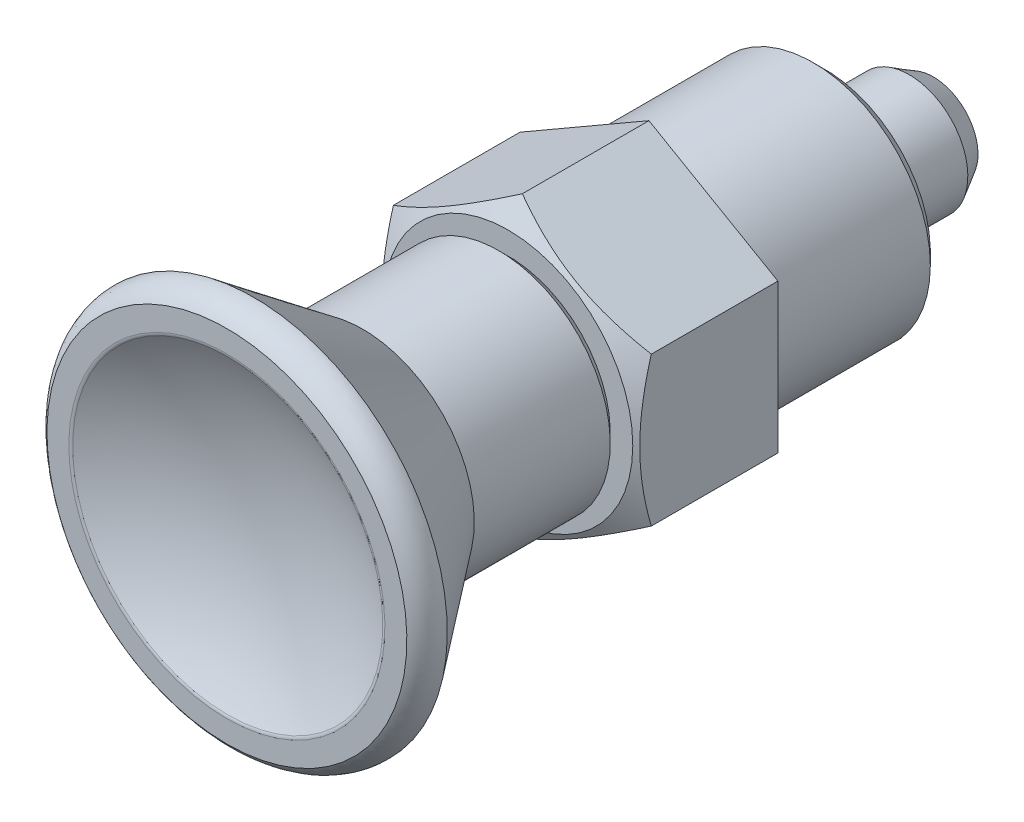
ISO-10303-21;
HEADER;
FILE_DESCRIPTION(('STEP AP214'),'2;1');
FILE_NAME('part.step','',(''),(''),'','','');
FILE_SCHEMA(('AUTOMOTIVE_DESIGN { 1 0 10303 214 1 1 1 1 }'));
ENDSEC;
DATA;
#1=APPLICATION_CONTEXT('core data for automotive mechanical design processes');
#2=APPLICATION_PROTOCOL_DEFINITION('international standard','automotive_design',2000,#1);
#3=PRODUCT_CONTEXT('',#1,'mechanical');
#4=PRODUCT('Part','Part','',(#3));
#5=PRODUCT_RELATED_PRODUCT_CATEGORY('part','',(#4));
#6=PRODUCT_DEFINITION_FORMATION('','',#4);
#7=PRODUCT_DEFINITION_CONTEXT('part definition',#1,'design');
#8=PRODUCT_DEFINITION('design','',#6,#7);
#9=PRODUCT_DEFINITION_SHAPE('','',#8);
#10=(LENGTH_UNIT() NAMED_UNIT(*) SI_UNIT(.MILLI.,.METRE.));
#11=(NAMED_UNIT(*) PLANE_ANGLE_UNIT() SI_UNIT($,.RADIAN.));
#12=(NAMED_UNIT(*) SI_UNIT($,.STERADIAN.) SOLID_ANGLE_UNIT());
#13=UNCERTAINTY_MEASURE_WITH_UNIT(LENGTH_MEASURE(1.E-05),#10,'distance_accuracy_value','');
#14=(GEOMETRIC_REPRESENTATION_CONTEXT(3) GLOBAL_UNCERTAINTY_ASSIGNED_CONTEXT((#13)) GLOBAL_UNIT_ASSIGNED_CONTEXT((#10,
#11,#12)) REPRESENTATION_CONTEXT('',''));
#15=CARTESIAN_POINT('',(0.,0.,0.));
#16=DIRECTION('',(0.,0.,1.));
#17=DIRECTION('',(1.,0.,0.));
#18=AXIS2_PLACEMENT_3D('',#15,#16,#17);
#19=CARTESIAN_POINT('',(0.,7.21644966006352E-13,58.3153369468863));
#20=DIRECTION('',(0.,0.,-1.));
#21=DIRECTION('',(0.,-1.,0.));
#22=AXIS2_PLACEMENT_3D('',#19,#20,#21);
#23=SPHERICAL_SURFACE('',#22,25.9999999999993);
#24=CARTESIAN_POINT('',(0.,0.,35.9304780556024));
#25=DIRECTION('',(0.,0.,-1.));
#26=DIRECTION('',(0.,-1.,0.));
#27=AXIS2_PLACEMENT_3D('',#24,#25,#26);
#28=CIRCLE('',#27,13.2256603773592);
#29=CARTESIAN_POINT('',(0.,-13.2256603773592,35.9304780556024));
#30=VERTEX_POINT('',#29);
#31=EDGE_CURVE('E866',#30,#30,#28,.T.);
#32=ORIENTED_EDGE('',*,*,#31,.F.);
#33=EDGE_LOOP('',(#32));
#34=FACE_BOUND('',#33,.T.);
#35=ADVANCED_FACE('F14',(#34),#23,.F.);
#36=CARTESIAN_POINT('',(0.,0.,35.5));
#37=DIRECTION('',(0.,0.,-1.));
#38=DIRECTION('',(-1.,0.,0.));
#39=AXIS2_PLACEMENT_3D('',#36,#37,#38);
#40=TOROIDAL_SURFACE('',#39,13.4800000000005,0.500000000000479);
#41=ORIENTED_EDGE('',*,*,#31,.T.);
#42=EDGE_LOOP('',(#41));
#43=FACE_BOUND('',#42,.T.);
#44=CARTESIAN_POINT('',(0.,0.,36.0000000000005));
#45=DIRECTION('',(0.,0.,-1.));
#46=DIRECTION('',(0.,-1.,0.));
#47=AXIS2_PLACEMENT_3D('',#44,#45,#46);
#48=CIRCLE('',#47,13.48);
#49=CARTESIAN_POINT('',(0.,-13.48,36.0000000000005));
#50=VERTEX_POINT('',#49);
#51=EDGE_CURVE('E870',#50,#50,#48,.T.);
#52=ORIENTED_EDGE('',*,*,#51,.F.);
#53=EDGE_LOOP('',(#52));
#54=FACE_BOUND('',#53,.T.);
#55=ADVANCED_FACE('F119',(#43,#54),#40,.T.);
#56=CARTESIAN_POINT('',(-16.885,16.885,36.0000000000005));
#57=DIRECTION('',(0.,0.,1.));
#58=DIRECTION('',(0.,-1.,0.));
#59=AXIS2_PLACEMENT_3D('',#56,#57,#58);
#60=PLANE('',#59);
#61=CARTESIAN_POINT('',(0.,0.,36.0000000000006));
#62=DIRECTION('',(0.,0.,-1.));
#63=DIRECTION('',(0.,-1.,0.));
#64=AXIS2_PLACEMENT_3D('',#61,#62,#63);
#65=CIRCLE('',#64,15.35);
#66=CARTESIAN_POINT('',(0.,-15.35,36.0000000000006));
#67=VERTEX_POINT('',#66);
#68=EDGE_CURVE('E880',#67,#67,#65,.T.);
#69=ORIENTED_EDGE('',*,*,#68,.F.);
#70=EDGE_LOOP('',(#69));
#71=FACE_BOUND('',#70,.T.);
#72=ORIENTED_EDGE('',*,*,#51,.T.);
#73=EDGE_LOOP('',(#72));
#74=FACE_BOUND('',#73,.T.);
#75=ADVANCED_FACE('F121',(#71,#74),#60,.T.);
#76=CARTESIAN_POINT('',(0.,-15.35,36.0000000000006));
#77=CARTESIAN_POINT('',(0.,-16.615654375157,35.1898669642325));
#78=CARTESIAN_POINT('',(0.,-16.5,33.7000000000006));
#79=CARTESIAN_POINT('',(-26.5869798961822,-15.35,36.0000000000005));
#80=CARTESIAN_POINT('',(-28.779157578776,-16.6156543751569,35.1898669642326));
#81=CARTESIAN_POINT('',(-28.5788383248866,-16.5,33.7000000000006));
#82=CARTESIAN_POINT('',(-13.2934899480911,7.675,36.0000000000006));
#83=CARTESIAN_POINT('',(-14.389578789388,8.30782718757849,35.1898669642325));
#84=CARTESIAN_POINT('',(-14.2894191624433,8.25,33.7000000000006));
#85=CARTESIAN_POINT('',(0.,30.7,36.0000000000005));
#86=CARTESIAN_POINT('',(0.,33.2313087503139,35.1898669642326));
#87=CARTESIAN_POINT('',(0.,33.,33.7000000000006));
#88=CARTESIAN_POINT('',(13.2934899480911,7.675,36.0000000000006));
#89=CARTESIAN_POINT('',(14.389578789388,8.30782718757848,35.1898669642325));
#90=CARTESIAN_POINT('',(14.2894191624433,8.25,33.7000000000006));
#91=CARTESIAN_POINT('',(26.5869798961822,-15.35,36.0000000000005));
#92=CARTESIAN_POINT('',(28.7791575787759,-16.615654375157,35.1898669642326));
#93=CARTESIAN_POINT('',(28.5788383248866,-16.5,33.7000000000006));
#94=CARTESIAN_POINT('',(0.,-15.35,36.0000000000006));
#95=CARTESIAN_POINT('',(0.,-16.615654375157,35.1898669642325));
#96=CARTESIAN_POINT('',(0.,-16.5,33.7000000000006));
#97=(BOUNDED_SURFACE() B_SPLINE_SURFACE(2,2,((#76,#77,#78),(#79,#80,#81),(#82,#83,#84),(#85,#86,
#87),(#88,#89,#90),(#91,#92,#93),(#94,#95,#96)),.UNSPECIFIED.,.T.,.F.,
.F.) B_SPLINE_SURFACE_WITH_KNOTS((3,2,2,3),(3,3),(0.,18.7749492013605,37.5498984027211,
56.3248476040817),(0.,1.),
.UNSPECIFIED.) GEOMETRIC_REPRESENTATION_ITEM() RATIONAL_B_SPLINE_SURFACE(((1.,0.857079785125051,
1.),(0.5,0.428539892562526,0.5),(1.,0.857079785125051,1.),(0.5,0.428539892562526,0.5),(1.,
0.857079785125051,1.),(0.5,0.428539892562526,0.5),(1.,0.857079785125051,1.))) REPRESENTATION_ITEM('') SURFACE());
#98=CARTESIAN_POINT('',(0.,0.,33.7000000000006));
#99=DIRECTION('',(0.,0.,1.));
#100=DIRECTION('',(0.,-1.,0.));
#101=AXIS2_PLACEMENT_3D('',#98,#99,#100);
#102=CIRCLE('',#101,16.5);
#103=CARTESIAN_POINT('',(0.,-16.5,33.7000000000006));
#104=VERTEX_POINT('',#103);
#105=EDGE_CURVE('E877',#104,#104,#102,.T.);
#106=CARTESIAN_POINT('',(0.,-15.35,36.0000000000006));
#107=CARTESIAN_POINT('',(0.,-15.3556561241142,35.9963795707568));
#108=CARTESIAN_POINT('',(0.,-15.3612977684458,35.9927365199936));
#109=CARTESIAN_POINT('',(0.,-15.3725641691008,35.9853973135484));
#110=CARTESIAN_POINT('',(0.,-15.3781888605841,35.9817010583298));
#111=CARTESIAN_POINT('',(0.,-15.3894206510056,35.974255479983));
#112=CARTESIAN_POINT('',(0.,-15.395027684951,35.9705060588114));
#113=CARTESIAN_POINT('',(0.,-15.4062234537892,35.9629541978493));
#114=CARTESIAN_POINT('',(0.,-15.4118121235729,35.9591516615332));
#115=CARTESIAN_POINT('',(0.,-15.4229704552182,35.9514936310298));
#116=CARTESIAN_POINT('',(0.,-15.4285400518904,35.9476380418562));
#117=CARTESIAN_POINT('',(0.,-15.4396595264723,35.9398739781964));
#118=CARTESIAN_POINT('',(0.,-15.4452093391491,35.9359654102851));
#119=CARTESIAN_POINT('',(0.,-15.4562885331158,35.9280954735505));
#120=CARTESIAN_POINT('',(0.,-15.4618178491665,35.9241340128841));
#121=CARTESIAN_POINT('',(0.,-15.4728553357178,35.9161583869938));
#122=CARTESIAN_POINT('',(0.,-15.4783634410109,35.9121441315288));
#123=CARTESIAN_POINT('',(0.,-15.489357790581,35.9040630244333));
#124=CARTESIAN_POINT('',(0.,-15.4948439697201,35.8999960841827));
#125=CARTESIAN_POINT('',(0.,-15.5057937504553,35.8918097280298));
#126=CARTESIAN_POINT('',(0.,-15.5112572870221,35.8876902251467));
#127=CARTESIAN_POINT('',(0.,-15.5221610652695,35.8793988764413));
#128=CARTESIAN_POINT('',(0.,-15.527601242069,35.8752269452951));
#129=CARTESIAN_POINT('',(0.,-15.538457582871,35.8668308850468));
#130=CARTESIAN_POINT('',(0.,-15.5438736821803,35.8626066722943));
#131=CARTESIAN_POINT('',(0.,-15.5546811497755,35.8541062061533));
#132=CARTESIAN_POINT('',(0.,-15.5600724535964,35.849829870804));
#133=CARTESIAN_POINT('',(0.,-15.5708296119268,35.8412253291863));
#134=CARTESIAN_POINT('',(0.,-15.5761954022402,35.8368970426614));
#135=CARTESIAN_POINT('',(0.,-15.5869008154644,35.8281887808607));
#136=CARTESIAN_POINT('',(0.,-15.592240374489,35.8238087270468));
#137=CARTESIAN_POINT('',(0.,-15.6028926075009,35.8149971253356));
#138=CARTESIAN_POINT('',(0.,-15.6082052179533,35.8105655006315));
#139=CARTESIAN_POINT('',(0.,-15.6188028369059,35.8016509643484));
#140=CARTESIAN_POINT('',(0.,-15.6240877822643,35.7971679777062));
#141=CARTESIAN_POINT('',(0.,-15.634629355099,35.7881509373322));
#142=CARTESIAN_POINT('',(0.,-15.6398859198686,35.7836168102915));
#143=CARTESIAN_POINT('',(0.,-15.6503700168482,35.7744977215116));
#144=CARTESIAN_POINT('',(0.,-15.655597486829,35.7699126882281));
#145=CARTESIAN_POINT('',(0.,-15.6660226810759,35.7606920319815));
#146=CARTESIAN_POINT('',(0.,-15.6712203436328,35.7560563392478));
#147=CARTESIAN_POINT('',(0.,-15.6815852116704,35.7467346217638));
#148=CARTESIAN_POINT('',(0.,-15.6867523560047,35.7420485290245));
#149=CARTESIAN_POINT('',(0.,-15.6970554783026,35.7326262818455));
#150=CARTESIAN_POINT('',(0.,-15.7021913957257,35.7278900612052));
#151=CARTESIAN_POINT('',(0.,-15.7124313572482,35.7183678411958));
#152=CARTESIAN_POINT('',(0.,-15.717535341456,35.7135817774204));
#153=CARTESIAN_POINT('',(0.,-15.7277107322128,35.7039601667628));
#154=CARTESIAN_POINT('',(0.,-15.7327820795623,35.6991245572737));
#155=CARTESIAN_POINT('',(0.,-15.7428914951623,35.6894041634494));
#156=CARTESIAN_POINT('',(0.,-15.7479295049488,35.6845193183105));
#157=CARTESIAN_POINT('',(0.,-15.7579715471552,35.674700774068));
#158=CARTESIAN_POINT('',(0.,-15.7629755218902,35.6697670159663));
#159=CARTESIAN_POINT('',(0.,-15.7729487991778,35.6598509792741));
#160=CARTESIAN_POINT('',(0.,-15.7779180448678,35.6548686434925));
#161=CARTESIAN_POINT('',(0.,-15.7878211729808,35.6448557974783));
#162=CARTESIAN_POINT('',(0.,-15.7927549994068,35.639825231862));
#163=CARTESIAN_POINT('',(0.,-15.8025866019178,35.6297162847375));
#164=CARTESIAN_POINT('',(0.,-15.8074843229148,35.6246378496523));
#165=CARTESIAN_POINT('',(0.,-15.817243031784,35.6144335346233));
#166=CARTESIAN_POINT('',(0.,-15.8221039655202,35.6093076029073));
#167=CARTESIAN_POINT('',(0.,-15.8317884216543,35.5990086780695));
#168=CARTESIAN_POINT('',(0.,-15.8366118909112,35.5938356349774));
#169=CARTESIAN_POINT('',(0.,-15.8462207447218,35.5834428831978));
#170=CARTESIAN_POINT('',(0.,-15.8510060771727,35.5782231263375));
#171=CARTESIAN_POINT('',(0.,-15.8605379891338,35.5677373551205));
#172=CARTESIAN_POINT('',(0.,-15.8652845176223,35.5624712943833));
#173=CARTESIAN_POINT('',(0.,-15.8747381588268,35.551893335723));
#174=CARTESIAN_POINT('',(0.,-15.8794452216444,35.5465813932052));
#175=CARTESIAN_POINT('',(0.,-15.8888192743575,35.5359121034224));
#176=CARTESIAN_POINT('',(0.,-15.8934862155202,35.5305547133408));
#177=CARTESIAN_POINT('',(0.,-15.9027793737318,35.5197949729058));
#178=CARTESIAN_POINT('',(0.,-15.9074055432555,35.514392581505));
#179=CARTESIAN_POINT('',(0.,-15.9166165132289,35.5035432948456));
#180=CARTESIAN_POINT('',(0.,-15.9212012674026,35.4980963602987));
#181=CARTESIAN_POINT('',(0.,-15.9303287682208,35.4871584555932));
#182=CARTESIAN_POINT('',(0.,-15.9348714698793,35.4816674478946));
#183=CARTESIAN_POINT('',(0.,-15.9439142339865,35.4706418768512));
#184=CARTESIAN_POINT('',(0.,-15.9484142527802,35.4651072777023));
#185=CARTESIAN_POINT('',(0.,-15.9573710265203,35.4539950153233));
#186=CARTESIAN_POINT('',(0.,-15.9618277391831,35.4484173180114));
#187=CARTESIAN_POINT('',(0.,-15.9706972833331,35.437219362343));
#188=CARTESIAN_POINT('',(0.,-15.9751100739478,35.4315990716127));
#189=CARTESIAN_POINT('',(0.,-15.9838911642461,35.420316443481));
#190=CARTESIAN_POINT('',(0.,-15.9882594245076,35.414654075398));
#191=CARTESIAN_POINT('',(0.,-15.9969508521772,35.4032878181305));
#192=CARTESIAN_POINT('',(0.,-16.0012739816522,35.3975838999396));
#193=CARTESIAN_POINT('',(0.,-16.0098745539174,35.3861350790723));
#194=CARTESIAN_POINT('',(0.,-16.0141519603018,35.3803901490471));
#195=CARTESIAN_POINT('',(0.,-16.0226605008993,35.3688598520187));
#196=CARTESIAN_POINT('',(0.,-16.0268916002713,35.3630744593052));
#197=CARTESIAN_POINT('',(0.,-16.035306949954,35.3514637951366));
#198=CARTESIAN_POINT('',(0.,-16.039491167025,35.3456384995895));
#199=CARTESIAN_POINT('',(0.,-16.0478121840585,35.33394859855));
#200=CARTESIAN_POINT('',(0.,-16.0519489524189,35.3280839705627));
#201=CARTESIAN_POINT('',(0.,-16.0601745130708,35.316315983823));
#202=CARTESIAN_POINT('',(0.,-16.0642632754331,35.3104126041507));
#203=CARTESIAN_POINT('',(0.,-16.072392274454,35.2985677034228));
#204=CARTESIAN_POINT('',(0.,-16.0764324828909,35.292626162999));
#205=CARTESIAN_POINT('',(0.,-16.0844638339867,35.2807055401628));
#206=CARTESIAN_POINT('',(0.,-16.0884549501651,35.2747264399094));
#207=CARTESIAN_POINT('',(0.,-16.0963875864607,35.2627313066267));
#208=CARTESIAN_POINT('',(0.,-16.1003290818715,35.2567152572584));
#209=CARTESIAN_POINT('',(0.,-16.1081619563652,35.2446468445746));
#210=CARTESIAN_POINT('',(0.,-16.1120533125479,35.238594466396));
#211=CARTESIAN_POINT('',(0.,-16.1197853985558,35.2264540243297));
#212=CARTESIAN_POINT('',(0.,-16.1236261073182,35.2203659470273));
#213=CARTESIAN_POINT('',(0.,-16.131256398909,35.2081547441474));
#214=CARTESIAN_POINT('',(0.,-16.1350459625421,35.2020316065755));
#215=CARTESIAN_POINT('',(0.,-16.1425734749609,35.1897509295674));
#216=CARTESIAN_POINT('',(0.,-16.1463114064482,35.183593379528));
#217=CARTESIAN_POINT('',(0.,-16.15373517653,35.1712445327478));
#218=CARTESIAN_POINT('',(0.,-16.1574209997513,35.1650532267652));
#219=CARTESIAN_POINT('',(0.,-16.1647400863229,35.1526375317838));
#220=CARTESIAN_POINT('',(0.,-16.1683733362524,35.1464131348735));
#221=CARTESIAN_POINT('',(0.,-16.175586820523,35.1339319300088));
#222=CARTESIAN_POINT('',(0.,-16.179167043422,35.1276751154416));
#223=CARTESIAN_POINT('',(0.,-16.1862740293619,35.1151297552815));
#224=CARTESIAN_POINT('',(0.,-16.1898007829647,35.1088412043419));
#225=CARTESIAN_POINT('',(0.,-16.196800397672,35.0962330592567));
#226=CARTESIAN_POINT('',(0.,-16.2002732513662,35.0899134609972));
#227=CARTESIAN_POINT('',(0.,-16.2071646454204,35.0772439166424));
#228=CARTESIAN_POINT('',(0.,-16.210583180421,35.0708939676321));
#229=CARTESIAN_POINT('',(0.,-16.2173655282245,35.0581644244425));
#230=CARTESIAN_POINT('',(0.,-16.2207293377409,35.0517848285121));
#231=CARTESIAN_POINT('',(0.,-16.2274018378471,35.0389967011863));
#232=CARTESIAN_POINT('',(0.,-16.2307105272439,35.0325881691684));
#233=CARTESIAN_POINT('',(0.,-16.237272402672,35.0197428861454));
#234=CARTESIAN_POINT('',(0.,-16.2405255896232,35.0133061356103));
#235=CARTESIAN_POINT('',(0.,-16.2469760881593,35.000405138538));
#236=CARTESIAN_POINT('',(0.,-16.2501734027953,34.9939408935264));
#237=CARTESIAN_POINT('',(0.,-16.2565117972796,34.9809856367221));
#238=CARTESIAN_POINT('',(0.,-16.2596528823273,34.9744946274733));
#239=CARTESIAN_POINT('',(0.,-16.2658784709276,34.9614865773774));
#240=CARTESIAN_POINT('',(0.,-16.2689629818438,34.9549695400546));
#241=CARTESIAN_POINT('',(0.,-16.275075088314,34.9419101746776));
#242=CARTESIAN_POINT('',(0.,-16.2781026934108,34.9353678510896));
#243=CARTESIAN_POINT('',(0.,-16.2841006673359,34.9222586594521));
#244=CARTESIAN_POINT('',(0.,-16.2870710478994,34.9156917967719));
#245=CARTESIAN_POINT('',(0.,-16.2929542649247,34.9025342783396));
#246=CARTESIAN_POINT('',(0.,-16.2958671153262,34.8959436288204));
#247=CARTESIAN_POINT('',(0.,-16.3016349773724,34.882739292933));
#248=CARTESIAN_POINT('',(0.,-16.3044900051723,34.8761256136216));
#249=CARTESIAN_POINT('',(0.,-16.3101419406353,34.862875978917));
#250=CARTESIAN_POINT('',(0.,-16.3129388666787,34.8562400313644));
#251=CARTESIAN_POINT('',(0.,-16.3184743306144,34.8429466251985));
#252=CARTESIAN_POINT('',(0.,-16.3212128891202,34.8362891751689));
#253=CARTESIAN_POINT('',(0.,-16.3266313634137,34.822953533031));
#254=CARTESIAN_POINT('',(0.,-16.3293113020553,34.8162753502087));
#255=CARTESIAN_POINT('',(0.,-16.3346122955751,34.8028990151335));
#256=CARTESIAN_POINT('',(0.,-16.3372333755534,34.7962008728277));
#257=CARTESIAN_POINT('',(0.,-16.3424164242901,34.7827853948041));
#258=CARTESIAN_POINT('',(0.,-16.3449784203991,34.7760680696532));
#259=CARTESIAN_POINT('',(0.,-16.3500430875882,34.7626150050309));
#260=CARTESIAN_POINT('',(0.,-16.3525457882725,34.7558792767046));
#261=CARTESIAN_POINT('',(0.,-16.357491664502,34.7423901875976));
#262=CARTESIAN_POINT('',(0.,-16.3599348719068,34.7356368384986));
#263=CARTESIAN_POINT('',(0.,-16.364761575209,34.722113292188));
#264=CARTESIAN_POINT('',(0.,-16.367145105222,34.7153431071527));
#265=CARTESIAN_POINT('',(0.,-16.3718522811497,34.7017866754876));
#266=CARTESIAN_POINT('',(0.,-16.3741759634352,34.6950004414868));
#267=CARTESIAN_POINT('',(0.,-16.3787632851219,34.6814127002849));
#268=CARTESIAN_POINT('',(0.,-16.3810269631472,34.6746112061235));
#269=CARTESIAN_POINT('',(0.,-16.3854941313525,34.6609937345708));
#270=CARTESIAN_POINT('',(0.,-16.3876976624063,34.654177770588));
#271=CARTESIAN_POINT('',(0.,-16.3920444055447,34.6405321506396));
#272=CARTESIAN_POINT('',(0.,-16.3941876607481,34.6337025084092));
#273=CARTESIAN_POINT('',(0.,-16.3984137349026,34.62003032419));
#274=CARTESIAN_POINT('',(0.,-16.4004965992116,34.6131877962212));
#275=CARTESIAN_POINT('',(0.,-16.404601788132,34.5994906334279));
#276=CARTESIAN_POINT('',(0.,-16.4066241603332,34.5926360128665));
#277=CARTESIAN_POINT('',(0.,-16.4106082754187,34.5789154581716));
#278=CARTESIAN_POINT('',(0.,-16.4125700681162,34.5720495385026));
#279=CARTESIAN_POINT('',(0.,-16.4164329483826,34.55830717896));
#280=CARTESIAN_POINT('',(0.,-16.4183340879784,34.5514307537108));
#281=CARTESIAN_POINT('',(0.,-16.4220756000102,34.5376681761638));
#282=CARTESIAN_POINT('',(0.,-16.4239160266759,34.5307820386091));
#283=CARTESIAN_POINT('',(0.,-16.4275360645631,34.5170008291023));
#284=CARTESIAN_POINT('',(0.,-16.429315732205,34.5101057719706));
#285=CARTESIAN_POINT('',(0.,-16.4328142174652,34.4963075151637));
#286=CARTESIAN_POINT('',(0.,-16.4345330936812,34.4894043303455));
#287=CARTESIAN_POINT('',(0.,-16.4379099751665,34.4755906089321));
#288=CARTESIAN_POINT('',(0.,-16.4395680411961,34.4686800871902));
#289=CARTESIAN_POINT('',(0.,-16.4428232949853,34.4548524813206));
#290=CARTESIAN_POINT('',(0.,-16.4444205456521,34.4479354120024));
#291=CARTESIAN_POINT('',(0.,-16.4475541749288,34.4340954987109));
#292=CARTESIAN_POINT('',(0.,-16.4490906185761,34.4271726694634));
#293=CARTESIAN_POINT('',(0.,-16.4521026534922,34.4133220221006));
#294=CARTESIAN_POINT('',(0.,-16.4535783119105,34.406394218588));
#295=CARTESIAN_POINT('',(0.,-16.4564688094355,34.3925344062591));
#296=CARTESIAN_POINT('',(0.,-16.4578837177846,34.3856024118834));
#297=CARTESIAN_POINT('',(0.,-16.4606527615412,34.3717349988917));
#298=CARTESIAN_POINT('',(0.,-16.4620069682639,34.3647995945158));
#299=CARTESIAN_POINT('',(0.,-16.46465466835,34.3509261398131));
#300=CARTESIAN_POINT('',(0.,-16.4659482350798,34.3439881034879));
#301=CARTESIAN_POINT('',(0.,-16.4684747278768,34.3301101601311));
#302=CARTESIAN_POINT('',(0.,-16.4697077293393,34.3231702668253));
#303=CARTESIAN_POINT('',(0.,-16.4721131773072,34.3092893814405));
#304=CARTESIAN_POINT('',(0.,-16.4732857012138,34.3023484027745));
#305=CARTESIAN_POINT('',(0.,-16.4755702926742,34.288466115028));
#306=CARTESIAN_POINT('',(0.,-16.4766824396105,34.2815248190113));
#307=CARTESIAN_POINT('',(0.,-16.4788463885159,34.2676426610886));
#308=CARTESIAN_POINT('',(0.,-16.4798982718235,34.2607018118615));
#309=CARTESIAN_POINT('',(0.,-16.4819418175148,34.2468213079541));
#310=CARTESIAN_POINT('',(0.,-16.4829335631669,34.2398816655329));
#311=CARTESIAN_POINT('',(0.,-16.4848569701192,34.2260043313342));
#312=CARTESIAN_POINT('',(0.,-16.4857887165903,34.2190666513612));
#313=CARTESIAN_POINT('',(0.,-16.487592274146,34.2051939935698));
#314=CARTESIAN_POINT('',(0.,-16.4884641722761,34.1982590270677));
#315=CARTESIAN_POINT('',(0.,-16.4901481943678,34.184392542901));
#316=CARTESIAN_POINT('',(0.,-16.4909604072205,34.1774610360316));
#317=CARTESIAN_POINT('',(0.,-16.4925252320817,34.1636022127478));
#318=CARTESIAN_POINT('',(0.,-16.4932779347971,34.1566749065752));
#319=CARTESIAN_POINT('',(0.,-16.4947239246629,34.1428252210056));
#320=CARTESIAN_POINT('',(0.,-16.4954173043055,34.1359028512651));
#321=CARTESIAN_POINT('',(0.,-16.4967448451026,34.1220637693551));
#322=CARTESIAN_POINT('',(0.,-16.4973791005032,34.1151470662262));
#323=CARTESIAN_POINT('',(0.,-16.4985886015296,34.1013200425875));
#324=CARTESIAN_POINT('',(0.,-16.4991639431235,34.0944097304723));
#325=CARTESIAN_POINT('',(0.,-16.5002558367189,34.0805962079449));
#326=CARTESIAN_POINT('',(0.,-16.5007724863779,34.0736930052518));
#327=CARTESIAN_POINT('',(0.,-16.5017472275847,34.059894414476));
#328=CARTESIAN_POINT('',(0.,-16.5022054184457,34.0529990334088));
#329=CARTESIAN_POINT('',(0.,-16.5030634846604,34.039216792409));
#330=CARTESIAN_POINT('',(0.,-16.503463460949,34.0323299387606));
#331=CARTESIAN_POINT('',(0.,-16.5042053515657,34.0185654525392));
#332=CARTESIAN_POINT('',(0.,-16.5045473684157,34.011687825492));
#333=CARTESIAN_POINT('',(0.,-16.5051736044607,33.9979424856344));
#334=CARTESIAN_POINT('',(0.,-16.5054579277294,33.9910747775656));
#335=CARTESIAN_POINT('',(0.,-16.5059690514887,33.977349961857));
#336=CARTESIAN_POINT('',(0.,-16.5061959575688,33.9704928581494));
#337=CARTESIAN_POINT('',(0.,-16.5065925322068,33.9567899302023));
#338=CARTESIAN_POINT('',(0.,-16.506762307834,33.9499441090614));
#339=CARTESIAN_POINT('',(0.,-16.5070449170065,33.9362644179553));
#340=CARTESIAN_POINT('',(0.,-16.507157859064,33.9294305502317));
#341=CARTESIAN_POINT('',(0.,-16.5073271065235,33.9157754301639));
#342=CARTESIAN_POINT('',(0.,-16.5073835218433,33.9089541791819));
#343=CARTESIAN_POINT('',(0.,-16.5074400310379,33.8953249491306));
#344=CARTESIAN_POINT('',(0.,-16.5074402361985,33.8885169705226));
#345=CARTESIAN_POINT('',(0.,-16.5073846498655,33.8749149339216));
#346=CARTESIAN_POINT('',(0.,-16.5073289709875,33.8681208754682));
#347=CARTESIAN_POINT('',(0.,-16.5071619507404,33.8545473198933));
#348=CARTESIAN_POINT('',(0.,-16.5070507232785,33.84776782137));
#349=CARTESIAN_POINT('',(0.,-16.5067729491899,33.8342240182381));
#350=CARTESIAN_POINT('',(0.,-16.5066065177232,33.8274597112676));
#351=CARTESIAN_POINT('',(0.,-16.5062186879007,33.8139469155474));
#352=CARTESIAN_POINT('',(0.,-16.5059974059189,33.8071984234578));
#353=CARTESIAN_POINT('',(0.,-16.5055002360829,33.7937178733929));
#354=CARTESIAN_POINT('',(0.,-16.5052244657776,33.7869858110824));
#355=CARTESIAN_POINT('',(0.,-16.5046186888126,33.7735387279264));
#356=CARTESIAN_POINT('',(0.,-16.5042888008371,33.7668237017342));
#357=CARTESIAN_POINT('',(0.,-16.503575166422,33.7534112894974));
#358=CARTESIAN_POINT('',(0.,-16.503191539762,33.7467138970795));
#359=CARTESIAN_POINT('',(0.,-16.5023708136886,33.7333373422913));
#360=CARTESIAN_POINT('',(0.,-16.5019338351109,33.726658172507));
#361=CARTESIAN_POINT('',(0.,-16.5010067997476,33.7133186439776));
#362=CARTESIAN_POINT('',(0.,-16.5005168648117,33.7066582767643));
#363=CARTESIAN_POINT('',(0.,-16.5,33.7000000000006));
#364=B_SPLINE_CURVE_WITH_KNOTS('',3,(#106,#107,#108,#109,#110,#111,#112,#113,#114,#115,#116,
#117,#118,#119,#120,#121,#122,#123,#124,#125,#126,#127,#128,#129,#130,#131,#132,#133,#134,#135,
#136,#137,#138,#139,#140,#141,#142,#143,#144,#145,#146,#147,#148,#149,#150,#151,#152,#153,#154,
#155,#156,#157,#158,#159,#160,#161,#162,#163,#164,#165,#166,#167,#168,#169,#170,#171,#172,#173,
#174,#175,#176,#177,#178,#179,#180,#181,#182,#183,#184,#185,#186,#187,#188,#189,#190,#191,#192,
#193,#194,#195,#196,#197,#198,#199,#200,#201,#202,#203,#204,#205,#206,#207,#208,#209,#210,#211,
#212,#213,#214,#215,#216,#217,#218,#219,#220,#221,#222,#223,#224,#225,#226,#227,#228,#229,#230,
#231,#232,#233,#234,#235,#236,#237,#238,#239,#240,#241,#242,#243,#244,#245,#246,#247,#248,#249,
#250,#251,#252,#253,#254,#255,#256,#257,#258,#259,#260,#261,#262,#263,#264,#265,#266,#267,#268,
#269,#270,#271,#272,#273,#274,#275,#276,#277,#278,#279,#280,#281,#282,#283,#284,#285,#286,#287,
#288,#289,#290,#291,#292,#293,#294,#295,#296,#297,#298,#299,#300,#301,#302,#303,#304,#305,#306,
#307,#308,#309,#310,#311,#312,#313,#314,#315,#316,#317,#318,#319,#320,#321,#322,#323,#324,#325,
#326,#327,#328,#329,#330,#331,#332,#333,#334,#335,#336,#337,#338,#339,#340,#341,#342,#343,#344,
#345,#346,#347,#348,#349,#350,#351,#352,#353,#354,#355,#356,#357,#358,#359,#360,#361,#362,#363),
.UNSPECIFIED.,.F.,.F.,(4,2,2,2,2,2,2,2,2,2,2,2,2,2,2,2,2,2,2,2,2,2,2,2,2,2,2,2,2,2,2,2,2,2,2,2,
2,2,2,2,2,2,2,2,2,2,2,2,2,2,2,2,2,2,2,2,2,2,2,2,2,2,2,2,2,2,2,2,2,2,2,2,2,2,2,2,2,2,2,2,2,2,2,2,
2,2,2,2,2,2,2,2,2,2,2,2,2,2,2,2,2,2,2,2,2,2,2,2,2,2,2,2,2,2,2,2,2,2,2,2,2,2,2,2,2,2,2,2,4),(0.,
0.0201467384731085,0.0403379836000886,0.0605732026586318,0.0808518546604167,0.101173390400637,
0.121537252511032,0.141942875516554,0.162389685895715,0.182877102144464,0.20340453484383,
0.223971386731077,0.24457705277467,0.265220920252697,0.285902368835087,0.306620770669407,
0.327375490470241,0.348165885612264,0.368991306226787,0.389851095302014,0.41074458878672,
0.431671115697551,0.452629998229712,0.473620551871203,0.49464208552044,0.515693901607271,
0.536775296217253,0.557885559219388,0.579023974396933,0.600189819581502,0.621382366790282,
0.642600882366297,0.663844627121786,0.685112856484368,0.706404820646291,0.727719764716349,
0.749056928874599,0.770415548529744,0.791794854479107,0.813194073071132,0.834612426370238,
0.856049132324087,0.877503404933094,0.89897445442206,0.920461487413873,0.941963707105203,
0.963480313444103,0.985010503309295,1.00655347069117,1.02810840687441,1.049674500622,
1.07125093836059,1.09283690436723,1.11443158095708,1.13603414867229,1.15764378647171,
1.17925967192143,1.20088098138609,1.22250689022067,1.24413657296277,1.26576920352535,
1.28740395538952,1.30904000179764,1.33067651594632,1.35231267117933,1.37394764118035,
1.39558060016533,1.41721072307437,1.43883718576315,1.46045916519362,1.48207583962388,
1.50368638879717,1.52528999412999,1.54688583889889,1.56847310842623,1.59005099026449,
1.61161867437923,1.63317535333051,1.65472022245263,1.6762524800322,1.69777132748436,
1.71927596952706,1.74076561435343,1.76223947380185,1.78369676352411,1.805136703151,
1.82655851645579,1.84796143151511,1.86934468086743,1.89070750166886,1.91204913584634,
1.93336883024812,1.95466583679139,1.97593941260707,1.99718882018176,2.01841332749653,
2.03961220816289,2.0607847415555,2.08193021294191,2.10304791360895,2.12413714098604,
2.14519719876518,2.16622739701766,2.18722705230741,2.20819548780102,2.22913203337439,
2.25003602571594,2.27090680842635,2.291743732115,2.31254615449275,2.33331344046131,
2.35404496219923,2.37474009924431,2.39539823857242,2.41601877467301,2.436601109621,
2.45714465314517,2.47764882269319,2.49811304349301,2.51853674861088,2.53891937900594,
2.55926038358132,2.57955921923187,2.59981535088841,2.62002825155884,2.64019740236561,
2.66032229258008,2.68040241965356,2.70043728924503),.UNSPECIFIED.);
#365=EDGE_CURVE('BSEAM129',#67,#104,#364,.T.);
#366=ORIENTED_EDGE('',*,*,#68,.T.);
#367=ORIENTED_EDGE('',*,*,#105,.T.);
#368=ORIENTED_EDGE('',*,*,#365,.T.);
#369=ORIENTED_EDGE('',*,*,#365,.F.);
#370=EDGE_LOOP('',(#366,#368,#367,#369));
#371=FACE_BOUND('',#370,.T.);
#372=ADVANCED_FACE('F129',(#371),#97,.T.);
#373=CARTESIAN_POINT('',(0.,0.,24.4));
#374=DIRECTION('',(0.,0.,1.));
#375=DIRECTION('',(0.,-1.,0.));
#376=AXIS2_PLACEMENT_3D('',#373,#374,#375);
#377=CONICAL_SURFACE('',#376,9.5,0.645219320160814);
#378=ORIENTED_EDGE('',*,*,#105,.F.);
#379=EDGE_LOOP('',(#378));
#380=FACE_BOUND('',#379,.T.);
#381=CARTESIAN_POINT('',(0.,0.,24.4));
#382=DIRECTION('',(0.,0.,-1.));
#383=DIRECTION('',(0.,-1.,0.));
#384=AXIS2_PLACEMENT_3D('',#381,#382,#383);
#385=CIRCLE('',#384,9.5);
#386=CARTESIAN_POINT('',(0.,-9.5,24.4));
#387=VERTEX_POINT('',#386);
#388=EDGE_CURVE('E885',#387,#387,#385,.T.);
#389=ORIENTED_EDGE('',*,*,#388,.F.);
#390=EDGE_LOOP('',(#389));
#391=FACE_BOUND('',#390,.T.);
#392=ADVANCED_FACE('F142',(#380,#391),#377,.T.);
#393=CARTESIAN_POINT('',(0.,0.,24.4));
#394=DIRECTION('',(0.,0.,-1.));
#395=DIRECTION('',(0.,-1.,0.));
#396=AXIS2_PLACEMENT_3D('',#393,#394,#395);
#397=CYLINDRICAL_SURFACE('',#396,9.5);
#398=CARTESIAN_POINT('',(0.,0.,12.8));
#399=DIRECTION('',(0.,0.,1.));
#400=DIRECTION('',(0.,-1.,0.));
#401=AXIS2_PLACEMENT_3D('',#398,#399,#400);
#402=CIRCLE('',#401,9.5);
#403=CARTESIAN_POINT('',(0.,-9.49999999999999,12.8));
#404=VERTEX_POINT('',#403);
#405=EDGE_CURVE('E898',#404,#404,#402,.T.);
#406=ORIENTED_EDGE('',*,*,#405,.T.);
#407=EDGE_LOOP('',(#406));
#408=FACE_BOUND('',#407,.T.);
#409=ORIENTED_EDGE('',*,*,#388,.T.);
#410=EDGE_LOOP('',(#409));
#411=FACE_BOUND('',#410,.T.);
#412=ADVANCED_FACE('F110',(#408,#411),#397,.T.);
#413=CARTESIAN_POINT('',(0.,0.,12.));
#414=DIRECTION('',(0.,0.,1.));
#415=DIRECTION('',(0.,-1.,0.));
#416=AXIS2_PLACEMENT_3D('',#413,#414,#415);
#417=CONICAL_SURFACE('',#416,8.7,0.785398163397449);
#418=ORIENTED_EDGE('',*,*,#405,.F.);
#419=EDGE_LOOP('',(#418));
#420=FACE_BOUND('',#419,.T.);
#421=CARTESIAN_POINT('',(0.,0.,12.));
#422=DIRECTION('',(0.,0.,-1.));
#423=DIRECTION('',(0.,-1.,0.));
#424=AXIS2_PLACEMENT_3D('',#421,#422,#423);
#425=CIRCLE('',#424,8.7);
#426=CARTESIAN_POINT('',(0.,-8.7,12.));
#427=VERTEX_POINT('',#426);
#428=EDGE_CURVE('E904',#427,#427,#425,.T.);
#429=ORIENTED_EDGE('',*,*,#428,.F.);
#430=EDGE_LOOP('',(#429));
#431=FACE_BOUND('',#430,.T.);
#432=ADVANCED_FACE('F97',(#420,#431),#417,.T.);
#433=CARTESIAN_POINT('',(0.,-0.025872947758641,-14.9998534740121));
#434=DIRECTION('',(1.,1.3408363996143E-12,0.));
#435=DIRECTION('',(1.3408363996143E-12,-1.,0.));
#436=AXIS2_PLACEMENT_3D('',#433,#434,#435);
#437=CIRCLE('',#436,10.0001799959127);
#438=TRIMMED_CURVE('',#437,(PARAMETER_VALUE(-1.57338357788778)),
(PARAMETER_VALUE(1.57338357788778)),.T.,.PARAMETER.);
#439=CARTESIAN_POINT('',(0.,-1.91000067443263E-13,-14.9998534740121));
#440=DIRECTION('',(0.,0.,-1.));
#441=AXIS1_PLACEMENT('',#439,#440);
#442=SURFACE_OF_REVOLUTION('',#438,#441);
#443=CARTESIAN_POINT('',(0.,-1.05818132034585E-13,-24.2549576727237));
#444=DIRECTION('',(0.,0.,1.));
#445=DIRECTION('',(0.,-1.,0.));
#446=AXIS2_PLACEMENT_3D('',#443,#444,#445);
#447=CIRCLE('',#446,3.81356963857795);
#448=CARTESIAN_POINT('',(0.,-3.81356963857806,-24.2549576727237));
#449=VERTEX_POINT('',#448);
#450=EDGE_CURVE('E475',#449,#449,#447,.T.);
#451=ORIENTED_EDGE('',*,*,#450,.F.);
#452=EDGE_LOOP('',(#451));
#453=FACE_BOUND('',#452,.T.);
#454=CARTESIAN_POINT('',(0.,-1.00613961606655E-13,-25.));
#455=VERTEX_POINT('',#454);
#456=VERTEX_LOOP('',#455);
#457=FACE_BOUND('',#456,.T.);
#458=ADVANCED_FACE('F94',(#453,#457),#442,.T.);
#459=CARTESIAN_POINT('',(0.,-1.09815237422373E-13,-24.2549576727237));
#460=DIRECTION('',(0.,0.,1.));
#461=DIRECTION('',(0.,-1.,0.));
#462=AXIS2_PLACEMENT_3D('',#459,#460,#461);
#463=CONICAL_SURFACE('',#462,3.81356963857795,0.523598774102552);
#464=CARTESIAN_POINT('',(0.,-1.10154940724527E-13,-22.2));
#465=DIRECTION('',(0.,0.,1.));
#466=DIRECTION('',(0.,-1.,0.));
#467=AXIS2_PLACEMENT_3D('',#464,#465,#466);
#468=CIRCLE('',#467,4.99999999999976);
#469=CARTESIAN_POINT('',(0.,-4.99999999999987,-22.2));
#470=VERTEX_POINT('',#469);
#471=EDGE_CURVE('E468',#470,#470,#468,.T.);
#472=ORIENTED_EDGE('',*,*,#471,.F.);
#473=EDGE_LOOP('',(#472));
#474=FACE_BOUND('',#473,.T.);
#475=ORIENTED_EDGE('',*,*,#450,.T.);
#476=EDGE_LOOP('',(#475));
#477=FACE_BOUND('',#476,.T.);
#478=ADVANCED_FACE('F96',(#474,#477),#463,.T.);
#479=CARTESIAN_POINT('',(0.,-1.00358544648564E-13,-15.5));
#480=DIRECTION('',(0.,0.,-1.));
#481=DIRECTION('',(0.,-1.,0.));
#482=AXIS2_PLACEMENT_3D('',#479,#480,#481);
#483=CYLINDRICAL_SURFACE('',#482,4.99999999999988);
#484=CARTESIAN_POINT('',(0.,0.,-15.5));
#485=DIRECTION('',(0.,0.,1.));
#486=DIRECTION('',(0.,-1.,0.));
#487=AXIS2_PLACEMENT_3D('',#484,#485,#486);
#488=CIRCLE('',#487,5.);
#489=CARTESIAN_POINT('',(0.,-5.0000000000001,-15.5));
#490=VERTEX_POINT('',#489);
#491=EDGE_CURVE('E461',#490,#490,#488,.T.);
#492=ORIENTED_EDGE('',*,*,#491,.F.);
#493=EDGE_LOOP('',(#492));
#494=FACE_BOUND('',#493,.T.);
#495=ORIENTED_EDGE('',*,*,#471,.T.);
#496=EDGE_LOOP('',(#495));
#497=FACE_BOUND('',#496,.T.);
#498=ADVANCED_FACE('F107',(#494,#497),#483,.T.);
#499=CARTESIAN_POINT('',(0.,-1.01350855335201E-13,-15.3685640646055));
#500=DIRECTION('',(0.,0.,-1.));
#501=DIRECTION('',(0.,-1.,0.));
#502=AXIS2_PLACEMENT_3D('',#499,#500,#501);
#503=CONICAL_SURFACE('',#502,4.92411542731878,0.523598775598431);
#504=CARTESIAN_POINT('',(0.,-4.92679491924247,-15.3732050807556));
#505=CARTESIAN_POINT('',(0.623533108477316,-4.92679491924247,-15.3732050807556));
#506=CARTESIAN_POINT('',(1.87387541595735,-4.68665798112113,-15.3732050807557));
#507=CARTESIAN_POINT('',(3.45959435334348,-3.66879259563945,-15.3732050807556));
#508=CARTESIAN_POINT('',(4.44762821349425,-2.30485710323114,-15.3732050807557));
#509=CARTESIAN_POINT('',(4.8998810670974,-0.904722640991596,-15.3732050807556));
#510=CARTESIAN_POINT('',(4.97760564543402,0.568877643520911,-15.3732050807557));
#511=CARTESIAN_POINT('',(4.54353552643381,2.181826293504,-15.3732050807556));
#512=CARTESIAN_POINT('',(3.43763229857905,3.69114995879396,-15.3732050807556));
#513=CARTESIAN_POINT('',(1.83599115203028,4.70229067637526,-15.3732050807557));
#514=CARTESIAN_POINT('',(-0.0656595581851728,5.05119456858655,-15.3732050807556));
#515=CARTESIAN_POINT('',(-1.97823662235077,4.65194403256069,-15.3732050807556));
#516=CARTESIAN_POINT('',(-3.64664266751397,3.51491153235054,-15.3732050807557));
#517=CARTESIAN_POINT('',(-4.7151308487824,1.83167973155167,-15.3732050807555));
#518=CARTESIAN_POINT('',(-5.0421853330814,-0.0931396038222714,-15.3732050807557));
#519=CARTESIAN_POINT('',(-4.68654860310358,-1.79895958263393,-15.3732050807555));
#520=CARTESIAN_POINT('',(-3.86463917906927,-3.17010933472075,-15.3732050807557));
#521=CARTESIAN_POINT('',(-2.77771409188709,-4.15578195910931,-15.3732050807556));
#522=CARTESIAN_POINT('',(-1.45164339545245,-4.78329337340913,-15.3732050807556));
#523=CARTESIAN_POINT('',(-0.483380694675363,-4.92679491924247,-15.3732050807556));
#524=CARTESIAN_POINT('',(0.,-4.92679491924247,-15.3732050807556));
#525=(BOUNDED_CURVE() B_SPLINE_CURVE(3,(#504,#505,#506,#507,#508,#509,#510,#511,#512,#513,#514,
#515,#516,#517,#518,#519,#520,#521,#522,#523,#524),.UNSPECIFIED.,.T.,
.F.) B_SPLINE_CURVE_WITH_KNOTS((4,1,1,1,1,1,1,1,1,1,1,1,1,1,1,1,1,1,4),(2.,20.4908913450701,
38.9817826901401,56.8162968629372,69.5182221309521,82.2201473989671,100.17799371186,
118.135840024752,136.693729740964,155.251619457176,174.345847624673,193.440075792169,
213.883544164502,232.067311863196,250.25107956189,264.585747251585,278.92041494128,
293.255082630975,307.58975032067),
.UNSPECIFIED.) CURVE() GEOMETRIC_REPRESENTATION_ITEM() RATIONAL_B_SPLINE_CURVE((0.999999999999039,
0.999999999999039,0.999999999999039,0.999999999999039,0.999999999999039,0.999999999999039,
0.999999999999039,0.999999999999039,0.999999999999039,0.999999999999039,0.999999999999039,
0.999999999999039,0.999999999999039,0.999999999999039,0.999999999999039,0.999999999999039,
0.999999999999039,0.999999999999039,0.999999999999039,0.999999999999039,0.999999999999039)) REPRESENTATION_ITEM(''));
#526=CARTESIAN_POINT('',(0.,-4.92679491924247,-15.3732050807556));
#527=VERTEX_POINT('',#526);
#528=EDGE_CURVE('E450',#527,#527,#525,.F.);
#529=ORIENTED_EDGE('',*,*,#528,.T.);
#530=EDGE_LOOP('',(#529));
#531=FACE_BOUND('',#530,.T.);
#532=ORIENTED_EDGE('',*,*,#491,.T.);
#533=EDGE_LOOP('',(#532));
#534=FACE_BOUND('',#533,.T.);
#535=ADVANCED_FACE('F425',(#531,#534),#503,.T.);
#536=CARTESIAN_POINT('',(0.,-4.90000000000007,-15.2732050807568));
#537=CARTESIAN_POINT('',(0.620141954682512,-4.90000000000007,-15.2732050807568));
#538=CARTESIAN_POINT('',(1.86368413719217,-4.66116907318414,-15.2732050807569));
#539=CARTESIAN_POINT('',(3.4407789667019,-3.64883946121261,-15.2732050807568));
#540=CARTESIAN_POINT('',(4.42343929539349,-2.29232188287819,-15.2732050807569));
#541=CARTESIAN_POINT('',(4.87323252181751,-0.899802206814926,-15.2732050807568));
#542=CARTESIAN_POINT('',(4.9505343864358,0.565783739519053,-15.2732050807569));
#543=CARTESIAN_POINT('',(4.51882500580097,2.16996018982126,-15.2732050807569));
#544=CARTESIAN_POINT('',(3.41893635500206,3.6710752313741,-15.2732050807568));
#545=CARTESIAN_POINT('',(1.82600591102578,4.67671674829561,-15.2732050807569));
#546=CARTESIAN_POINT('',(-0.0653024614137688,5.02372308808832,-15.2732050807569));
#547=CARTESIAN_POINT('',(-1.96747776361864,4.62664392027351,-15.2732050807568));
#548=CARTESIAN_POINT('',(-3.62680999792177,3.49579529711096,-15.2732050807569));
#549=CARTESIAN_POINT('',(-4.68948708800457,1.82171793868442,-15.2732050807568));
#550=CARTESIAN_POINT('',(-5.01476285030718,-0.0926330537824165,-15.273205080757));
#551=CARTESIAN_POINT('',(-4.66106029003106,-1.78917574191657,-15.2732050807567));
#552=CARTESIAN_POINT('',(-3.84362091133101,-3.15286834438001,-15.273205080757));
#553=CARTESIAN_POINT('',(-2.762607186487,-4.13318027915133,-15.2732050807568));
#554=CARTESIAN_POINT('',(-1.44374847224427,-4.75727890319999,-15.2732050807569));
#555=CARTESIAN_POINT('',(-0.480751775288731,-4.90000000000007,-15.2732050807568));
#556=CARTESIAN_POINT('',(0.,-4.90000000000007,-15.2732050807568));
#557=CARTESIAN_POINT('',(0.,-4.90000000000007,-15.3267949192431));
#558=CARTESIAN_POINT('',(0.620141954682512,-4.90000000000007,-15.3267949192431));
#559=CARTESIAN_POINT('',(1.86368413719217,-4.66116907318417,-15.3267949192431));
#560=CARTESIAN_POINT('',(3.44077896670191,-3.64883946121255,-15.3267949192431));
#561=CARTESIAN_POINT('',(4.42343929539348,-2.29232188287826,-15.3267949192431));
#562=CARTESIAN_POINT('',(4.87323252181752,-0.899802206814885,-15.3267949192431));
#563=CARTESIAN_POINT('',(4.95053438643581,0.565783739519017,-15.3267949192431));
#564=CARTESIAN_POINT('',(4.51882500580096,2.16996018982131,-15.3267949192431));
#565=CARTESIAN_POINT('',(3.41893635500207,3.67107523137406,-15.3267949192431));
#566=CARTESIAN_POINT('',(1.82600591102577,4.67671674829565,-15.3267949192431));
#567=CARTESIAN_POINT('',(-0.0653024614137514,5.0237230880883,-15.3267949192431));
#568=CARTESIAN_POINT('',(-1.96747776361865,4.62664392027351,-15.3267949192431));
#569=CARTESIAN_POINT('',(-3.62680999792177,3.49579529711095,-15.3267949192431));
#570=CARTESIAN_POINT('',(-4.68948708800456,1.82171793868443,-15.3267949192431));
#571=CARTESIAN_POINT('',(-5.01476285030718,-0.09263305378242,-15.3267949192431));
#572=CARTESIAN_POINT('',(-4.66106029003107,-1.78917574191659,-15.3267949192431));
#573=CARTESIAN_POINT('',(-3.84362091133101,-3.15286834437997,-15.3267949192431));
#574=CARTESIAN_POINT('',(-2.762607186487,-4.13318027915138,-15.3267949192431));
#575=CARTESIAN_POINT('',(-1.44374847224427,-4.75727890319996,-15.3267949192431));
#576=CARTESIAN_POINT('',(-0.480751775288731,-4.90000000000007,-15.3267949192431));
#577=CARTESIAN_POINT('',(0.,-4.90000000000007,-15.3267949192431));
#578=CARTESIAN_POINT('',(0.,-4.9267949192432,-15.3732050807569));
#579=CARTESIAN_POINT('',(0.623533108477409,-4.9267949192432,-15.3732050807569));
#580=CARTESIAN_POINT('',(1.87387541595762,-4.68665798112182,-15.373205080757));
#581=CARTESIAN_POINT('',(3.45959435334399,-3.66879259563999,-15.3732050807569));
#582=CARTESIAN_POINT('',(4.44762821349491,-2.30485710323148,-15.373205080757));
#583=CARTESIAN_POINT('',(4.89988106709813,-0.90472264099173,-15.3732050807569));
#584=CARTESIAN_POINT('',(4.97760564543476,0.568877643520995,-15.373205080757));
#585=CARTESIAN_POINT('',(4.54353552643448,2.18182629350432,-15.3732050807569));
#586=CARTESIAN_POINT('',(3.43763229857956,3.69114995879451,-15.3732050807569));
#587=CARTESIAN_POINT('',(1.83599115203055,4.70229067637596,-15.373205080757));
#588=CARTESIAN_POINT('',(-0.0656595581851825,5.0511945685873,-15.3732050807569));
#589=CARTESIAN_POINT('',(-1.97823662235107,4.65194403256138,-15.3732050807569));
#590=CARTESIAN_POINT('',(-3.64664266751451,3.51491153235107,-15.373205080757));
#591=CARTESIAN_POINT('',(-4.7151308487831,1.83167973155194,-15.3732050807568));
#592=CARTESIAN_POINT('',(-5.04218533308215,-0.0931396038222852,-15.373205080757));
#593=CARTESIAN_POINT('',(-4.68654860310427,-1.79895958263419,-15.3732050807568));
#594=CARTESIAN_POINT('',(-3.86463917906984,-3.17010933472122,-15.373205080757));
#595=CARTESIAN_POINT('',(-2.7777140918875,-4.15578195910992,-15.3732050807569));
#596=CARTESIAN_POINT('',(-1.45164339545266,-4.78329337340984,-15.3732050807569));
#597=CARTESIAN_POINT('',(-0.483380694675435,-4.9267949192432,-15.3732050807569));
#598=CARTESIAN_POINT('',(0.,-4.9267949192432,-15.3732050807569));
#599=(BOUNDED_SURFACE() B_SPLINE_SURFACE(2,3,((#536,#537,#538,#539,#540,#541,#542,#543,#544,
#545,#546,#547,#548,#549,#550,#551,#552,#553,#554,#555,#556),(#557,#558,#559,#560,#561,#562,
#563,#564,#565,#566,#567,#568,#569,#570,#571,#572,#573,#574,#575,#576,#577),(#578,#579,#580,
#581,#582,#583,#584,#585,#586,#587,#588,#589,#590,#591,#592,#593,#594,#595,#596,#597,#598)),
.UNSPECIFIED.,.F.,.T.,.F.) B_SPLINE_SURFACE_WITH_KNOTS((3,3),(4,1,1,1,1,1,1,1,1,1,1,1,1,1,1,1,1,
1,4),(0.,1.),(2.,20.4908913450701,38.9817826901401,56.8162968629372,69.5182221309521,
82.2201473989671,100.17799371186,118.135840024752,136.693729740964,155.251619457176,
174.345847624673,193.440075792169,213.883544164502,232.067311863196,250.25107956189,
264.585747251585,278.92041494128,293.255082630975,307.58975032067),
.UNSPECIFIED.) GEOMETRIC_REPRESENTATION_ITEM() RATIONAL_B_SPLINE_SURFACE(((1.,1.,1.,1.,1.,1.,1.,
1.,1.,1.,1.,1.,1.,1.,1.,1.,1.,1.,1.,1.,1.),(0.965925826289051,0.965925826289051,
0.965925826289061,0.965925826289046,0.965925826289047,0.96592582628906,0.965925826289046,
0.965925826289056,0.965925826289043,0.965925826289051,0.965925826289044,0.965925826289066,
0.965925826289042,0.965925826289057,0.96592582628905,0.965925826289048,0.965925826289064,
0.965925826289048,0.965925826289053,0.965925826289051,0.965925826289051),(1.,1.,1.,1.,1.,1.,1.,
1.,1.,1.,1.,1.,1.,1.,1.,1.,1.,1.,1.,1.,1.))) REPRESENTATION_ITEM('') SURFACE());
#600=CARTESIAN_POINT('',(0.,-4.90000000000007,-15.2732050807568));
#601=CARTESIAN_POINT('',(-0.0711882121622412,-4.89999979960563,-15.2732050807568));
#602=CARTESIAN_POINT('',(-0.142375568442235,-4.89843529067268,-15.2732050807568));
#603=CARTESIAN_POINT('',(-0.284642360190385,-4.89219913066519,-15.2732050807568));
#604=CARTESIAN_POINT('',(-0.355721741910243,-4.8875262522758,-15.2732050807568));
#605=CARTESIAN_POINT('',(-0.497631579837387,-4.87509296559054,-15.2732050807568));
#606=CARTESIAN_POINT('',(-0.56846195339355,-4.86733161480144,-15.2732050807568));
#607=CARTESIAN_POINT('',(-0.709733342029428,-4.84874066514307,-15.2732050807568));
#608=CARTESIAN_POINT('',(-0.780174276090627,-4.83791045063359,-15.2732050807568));
#609=CARTESIAN_POINT('',(-0.920526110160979,-4.81320089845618,-15.2732050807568));
#610=CARTESIAN_POINT('',(-0.990436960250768,-4.79932127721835,-15.2732050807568));
#611=CARTESIAN_POINT('',(-1.12958815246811,-4.76853274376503,-15.2732050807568));
#612=CARTESIAN_POINT('',(-1.19882849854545,-4.75162384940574,-15.2732050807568));
#613=CARTESIAN_POINT('',(-1.33649748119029,-4.71479389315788,-15.2732050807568));
#614=CARTESIAN_POINT('',(-1.40492618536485,-4.69487308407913,-15.2732050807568));
#615=CARTESIAN_POINT('',(-1.54083526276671,-4.6520467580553,-15.2732050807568));
#616=CARTESIAN_POINT('',(-1.60831573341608,-4.62914155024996,-15.2732050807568));
#617=CARTESIAN_POINT('',(-1.74220755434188,-4.58040884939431,-15.2732050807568));
#618=CARTESIAN_POINT('',(-1.80861897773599,-4.55458155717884,-15.2732050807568));
#619=CARTESIAN_POINT('',(-1.94025122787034,-4.50006186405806,-15.2732050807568));
#620=CARTESIAN_POINT('',(-2.00547211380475,-4.47136960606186,-15.2732050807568));
#621=CARTESIAN_POINT('',(-2.13460216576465,-4.41117850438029,-15.2732050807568));
#622=CARTESIAN_POINT('',(-2.19851138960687,-4.37967978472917,-15.2732050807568));
#623=CARTESIAN_POINT('',(-2.32489669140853,-4.31393359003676,-15.2732050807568));
#624=CARTESIAN_POINT('',(-2.38737282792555,-4.2796862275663,-15.2732050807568));
#625=CARTESIAN_POINT('',(-2.51077129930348,-4.2085017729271,-15.2732050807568));
#626=CARTESIAN_POINT('',(-2.57169367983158,-4.17156475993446,-15.2732050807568));
#627=CARTESIAN_POINT('',(-2.69186116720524,-4.09505591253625,-15.2732050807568));
#628=CARTESIAN_POINT('',(-2.75110627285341,-4.05548407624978,-15.2732050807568));
#629=CARTESIAN_POINT('',(-2.86780757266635,-3.97378070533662,-15.2732050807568));
#630=CARTESIAN_POINT('',(-2.92526369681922,-3.93164907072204,-15.2732050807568));
#631=CARTESIAN_POINT('',(-3.03828897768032,-3.84492124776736,-15.2732050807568));
#632=CARTESIAN_POINT('',(-3.09385804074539,-3.80032493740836,-15.2732050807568));
#633=CARTESIAN_POINT('',(-3.203008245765,-3.70875855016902,-15.2732050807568));
#634=CARTESIAN_POINT('',(-3.25658931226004,-3.6617883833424,-15.2732050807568));
#635=CARTESIAN_POINT('',(-3.36166334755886,-3.56556621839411,-15.2732050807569));
#636=CARTESIAN_POINT('',(-3.41315628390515,-3.51631418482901,-15.2732050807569));
#637=CARTESIAN_POINT('',(-3.51395338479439,-3.41561969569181,-15.2732050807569));
#638=CARTESIAN_POINT('',(-3.56325756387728,-3.36417725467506,-15.2732050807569));
#639=CARTESIAN_POINT('',(-3.65957753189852,-3.25919418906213,-15.2732050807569));
#640=CARTESIAN_POINT('',(-3.70659336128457,-3.20565360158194,-15.2732050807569));
#641=CARTESIAN_POINT('',(-3.79823326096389,-3.09656371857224,-15.2732050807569));
#642=CARTESIAN_POINT('',(-3.84285734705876,-3.04101443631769,-15.2732050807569));
#643=CARTESIAN_POINT('',(-3.92963514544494,-2.92801724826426,-15.2732050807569));
#644=CARTESIAN_POINT('',(-3.97178880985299,-2.87056930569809,-15.2732050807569));
#645=CARTESIAN_POINT('',(-4.05355592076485,-2.75389090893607,-15.2732050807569));
#646=CARTESIAN_POINT('',(-4.09316929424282,-2.69466040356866,-15.2732050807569));
#647=CARTESIAN_POINT('',(-4.16978379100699,-2.57453132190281,-15.2732050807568));
#648=CARTESIAN_POINT('',(-4.20678484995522,-2.51363270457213,-15.2732050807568));
#649=CARTESIAN_POINT('',(-4.27810323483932,-2.39028224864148,-15.2732050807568));
#650=CARTESIAN_POINT('',(-4.31242051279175,-2.32783038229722,-15.2732050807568));
#651=CARTESIAN_POINT('',(-4.37829963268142,-2.20148817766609,-15.2732050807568));
#652=CARTESIAN_POINT('',(-4.40986142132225,-2.13759781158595,-15.2732050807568));
#653=CARTESIAN_POINT('',(-4.47015814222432,-2.00849333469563,-15.2732050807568));
#654=CARTESIAN_POINT('',(-4.49889296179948,-1.94327917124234,-15.2732050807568));
#655=CARTESIAN_POINT('',(-4.55346341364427,-1.81164241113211,-15.2732050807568));
#656=CARTESIAN_POINT('',(-4.57929879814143,-1.74521971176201,-15.2732050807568));
#657=CARTESIAN_POINT('',(-4.62804125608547,-1.61129995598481,-15.2732050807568));
#658=CARTESIAN_POINT('',(-4.65094798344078,-1.54380277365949,-15.2732050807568));
#659=CARTESIAN_POINT('',(-4.693804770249,-1.40786784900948,-15.2732050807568));
#660=CARTESIAN_POINT('',(-4.71375448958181,-1.33942999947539,-15.2732050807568));
#661=CARTESIAN_POINT('',(-4.75066856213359,-1.2017475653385,-15.2732050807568));
#662=CARTESIAN_POINT('',(-4.76763265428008,-1.13250291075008,-15.2732050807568));
#663=CARTESIAN_POINT('',(-4.79854673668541,-0.993340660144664,-15.2732050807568));
#664=CARTESIAN_POINT('',(-4.81249658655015,-0.923423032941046,-15.2732050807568));
#665=CARTESIAN_POINT('',(-4.83735349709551,-0.783048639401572,-15.2732050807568));
#666=CARTESIAN_POINT('',(-4.84826054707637,-0.712591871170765,-15.2732050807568));
#667=CARTESIAN_POINT('',(-4.86700276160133,-0.571272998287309,-15.2732050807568));
#668=CARTESIAN_POINT('',(-4.87483802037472,-0.500410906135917,-15.2732050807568));
#669=CARTESIAN_POINT('',(-4.88740908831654,-0.358415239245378,-15.2732050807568));
#670=CARTESIAN_POINT('',(-4.89214503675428,-0.287281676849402,-15.2732050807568));
#671=CARTESIAN_POINT('',(-4.89848435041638,-0.144876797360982,-15.2732050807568));
#672=CARTESIAN_POINT('',(-4.90008780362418,-0.0736054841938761,-15.2732050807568));
#673=CARTESIAN_POINT('',(-4.90015364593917,0.0689397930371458,-15.2732050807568));
#674=CARTESIAN_POINT('',(-4.89861597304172,0.140213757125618,-15.2732050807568));
#675=CARTESIAN_POINT('',(-4.89242711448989,0.282629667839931,-15.2732050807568));
#676=CARTESIAN_POINT('',(-4.88777577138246,0.353771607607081,-15.2732050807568));
#677=CARTESIAN_POINT('',(-4.87538010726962,0.495789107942,-15.2732050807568));
#678=CARTESIAN_POINT('',(-4.86763562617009,0.566664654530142,-15.2732050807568));
#679=CARTESIAN_POINT('',(-4.84907597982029,0.708014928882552,-15.2732050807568));
#680=CARTESIAN_POINT('',(-4.83826071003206,0.77848964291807,-15.2732050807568));
#681=CARTESIAN_POINT('',(-4.81358120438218,0.918903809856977,-15.2732050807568));
#682=CARTESIAN_POINT('',(-4.79971694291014,0.988843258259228,-15.2732050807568));
#683=CARTESIAN_POINT('',(-4.76896137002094,1.12805247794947,-15.2732050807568));
#684=CARTESIAN_POINT('',(-4.75207010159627,1.197322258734,-15.2732050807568));
#685=CARTESIAN_POINT('',(-4.71528207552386,1.33505756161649,-15.2732050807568));
#686=CARTESIAN_POINT('',(-4.69538538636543,1.40352310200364,-15.2732050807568));
#687=CARTESIAN_POINT('',(-4.65260936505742,1.53951594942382,-15.2732050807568));
#688=CARTESIAN_POINT('',(-4.62973005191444,1.6070432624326,-15.2732050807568));
#689=CARTESIAN_POINT('',(-4.58100714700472,1.74102332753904,-15.2732050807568));
#690=CARTESIAN_POINT('',(-4.55516342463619,1.80747603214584,-15.2732050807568));
#691=CARTESIAN_POINT('',(-4.50057903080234,1.9391879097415,-15.2732050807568));
#692=CARTESIAN_POINT('',(-4.47183807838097,2.00444696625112,-15.2732050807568));
#693=CARTESIAN_POINT('',(-4.41153403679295,2.13365634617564,-15.2732050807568));
#694=CARTESIAN_POINT('',(-4.37997063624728,2.19760652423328,-15.2732050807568));
#695=CARTESIAN_POINT('',(-4.31409436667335,2.32408196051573,-15.2732050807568));
#696=CARTESIAN_POINT('',(-4.27978124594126,2.38660708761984,-15.2732050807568));
#697=CARTESIAN_POINT('',(-4.20847866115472,2.51011644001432,-15.2732050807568));
#698=CARTESIAN_POINT('',(-4.17148905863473,2.57110058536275,-15.2732050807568));
#699=CARTESIAN_POINT('',(-4.09490642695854,2.69141187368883,-15.2732050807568));
#700=CARTESIAN_POINT('',(-4.05531339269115,2.75073901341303,-15.2732050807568));
#701=CARTESIAN_POINT('',(-3.97359688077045,2.86762022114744,-15.2732050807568));
#702=CARTESIAN_POINT('',(-3.93147352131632,2.92517437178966,-15.2732050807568));
#703=CARTESIAN_POINT('',(-3.84476916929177,3.03839336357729,-15.2732050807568));
#704=CARTESIAN_POINT('',(-3.80018838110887,3.09405836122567,-15.2732050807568));
#705=CARTESIAN_POINT('',(-3.70864266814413,3.20338339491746,-15.2732050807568));
#706=CARTESIAN_POINT('',(-3.66167797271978,3.25704362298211,-15.2732050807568));
#707=CARTESIAN_POINT('',(-3.56543558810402,3.36224137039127,-15.2732050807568));
#708=CARTESIAN_POINT('',(-3.51615807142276,3.41377904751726,-15.2732050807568));
#709=CARTESIAN_POINT('',(-3.41537098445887,3.51462202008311,-15.2732050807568));
#710=CARTESIAN_POINT('',(-3.3638614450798,3.56392734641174,-15.2732050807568));
#711=CARTESIAN_POINT('',(-3.25872791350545,3.66023295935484,-15.2732050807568));
#712=CARTESIAN_POINT('',(-3.20510384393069,3.7072331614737,-15.2732050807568));
#713=CARTESIAN_POINT('',(-3.09585378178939,3.79885165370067,-15.2732050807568));
#714=CARTESIAN_POINT('',(-3.04022768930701,3.84346982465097,-15.2732050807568));
#715=CARTESIAN_POINT('',(-2.92708734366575,3.93024841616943,-15.2732050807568));
#716=CARTESIAN_POINT('',(-2.86957302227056,3.97240874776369,-15.2732050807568));
#717=CARTESIAN_POINT('',(-2.75276957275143,4.05419544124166,-15.2732050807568));
#718=CARTESIAN_POINT('',(-2.6934804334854,4.09382178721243,-15.2732050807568));
#719=CARTESIAN_POINT('',(-2.57324079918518,4.17046437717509,-15.2732050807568));
#720=CARTESIAN_POINT('',(-2.51229035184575,4.20748069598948,-15.2732050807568));
#721=CARTESIAN_POINT('',(-2.38884143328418,4.27882686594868,-15.2732050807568));
#722=CARTESIAN_POINT('',(-2.32634305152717,4.31315687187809,-15.2732050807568));
#723=CARTESIAN_POINT('',(-2.19991197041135,4.3790547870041,-15.2732050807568));
#724=CARTESIAN_POINT('',(-2.13597937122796,4.41062288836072,-15.2732050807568));
#725=CARTESIAN_POINT('',(-2.0067922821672,4.47091871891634,-15.2732050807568));
#726=CARTESIAN_POINT('',(-1.94153786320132,4.49964660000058,-15.2732050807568));
#727=CARTESIAN_POINT('',(-1.80982498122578,4.55419416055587,-15.2732050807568));
#728=CARTESIAN_POINT('',(-1.74336652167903,4.58001384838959,-15.2732050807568));
#729=CARTESIAN_POINT('',(-1.60938120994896,4.62872140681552,-15.2732050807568));
#730=CARTESIAN_POINT('',(-1.5418543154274,4.65160916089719,-15.2732050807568));
#731=CARTESIAN_POINT('',(-1.40586493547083,4.69442386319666,-15.2732050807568));
#732=CARTESIAN_POINT('',(-1.33740240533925,4.7143506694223,-15.2732050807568));
#733=CARTESIAN_POINT('',(-1.19967523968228,4.7512158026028,-15.2732050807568));
#734=CARTESIAN_POINT('',(-1.13041057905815,4.76815403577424,-15.2732050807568));
#735=CARTESIAN_POINT('',(-0.99121242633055,4.79901387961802,-15.2732050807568));
#736=CARTESIAN_POINT('',(-0.921278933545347,4.81293548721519,-15.2732050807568));
#737=CARTESIAN_POINT('',(-0.780876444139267,4.83773405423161,-15.2732050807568));
#738=CARTESIAN_POINT('',(-0.710407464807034,4.84861111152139,-15.2732050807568));
#739=CARTESIAN_POINT('',(-0.569067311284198,4.86729229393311,-15.2732050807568));
#740=CARTESIAN_POINT('',(-0.498196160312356,4.87509659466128,-15.2732050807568));
#741=CARTESIAN_POINT('',(-0.356185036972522,4.88760483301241,-15.2732050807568));
#742=CARTESIAN_POINT('',(-0.28504508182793,4.89230896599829,-15.2732050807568));
#743=CARTESIAN_POINT('',(-0.142629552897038,4.89858642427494,-15.2732050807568));
#744=CARTESIAN_POINT('',(-0.0713539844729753,4.90015987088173,-15.2732050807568));
#745=CARTESIAN_POINT('',(0.0711982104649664,4.90015759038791,-15.2732050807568));
#746=CARTESIAN_POINT('',(0.142474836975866,4.89858180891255,-15.2732050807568));
#747=CARTESIAN_POINT('',(0.284894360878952,4.89231095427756,-15.2732050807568));
#748=CARTESIAN_POINT('',(0.356037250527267,4.88761570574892,-15.2732050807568));
#749=CARTESIAN_POINT('',(0.498055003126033,4.87512959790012,-15.2732050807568));
#750=CARTESIAN_POINT('',(0.568929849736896,4.86733855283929,-15.2732050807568));
#751=CARTESIAN_POINT('',(0.710277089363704,4.8486860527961,-15.2732050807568));
#752=CARTESIAN_POINT('',(0.780749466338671,4.83782447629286,-15.2732050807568));
#753=CARTESIAN_POINT('',(0.92115734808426,4.81305557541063,-15.2732050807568));
#754=CARTESIAN_POINT('',(0.991092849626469,4.79914823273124,-15.2732050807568));
#755=CARTESIAN_POINT('',(1.13029258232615,4.7683126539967,-15.2732050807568));
#756=CARTESIAN_POINT('',(1.1995568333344,4.75138450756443,-15.2732050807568));
#757=CARTESIAN_POINT('',(1.3372794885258,4.71453171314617,-15.2732050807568));
#758=CARTESIAN_POINT('',(1.40573793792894,4.69460723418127,-15.2732050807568));
#759=CARTESIAN_POINT('',(1.54171504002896,4.65178779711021,-15.2732050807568));
#760=CARTESIAN_POINT('',(1.60923375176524,4.62889302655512,-15.2732050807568));
#761=CARTESIAN_POINT('',(1.74319509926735,4.58015313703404,-15.2732050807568));
#762=CARTESIAN_POINT('',(1.80963777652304,4.5543081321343,-15.2732050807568));
#763=CARTESIAN_POINT('',(1.94132066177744,4.49971559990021,-15.2732050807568));
#764=CARTESIAN_POINT('',(2.00656085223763,4.4709680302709,-15.2732050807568));
#765=CARTESIAN_POINT('',(2.13572561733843,4.41064873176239,-15.2732050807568));
#766=CARTESIAN_POINT('',(2.19965013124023,4.3790768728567,-15.2732050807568));
#767=CARTESIAN_POINT('',(2.32606795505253,4.31318081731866,-15.2732050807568));
#768=CARTESIAN_POINT('',(2.38856120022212,4.27885649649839,-15.2732050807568));
#769=CARTESIAN_POINT('',(2.5120015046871,4.20752897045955,-15.2732050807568));
#770=CARTESIAN_POINT('',(2.57294852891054,4.17052570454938,-15.2732050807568));
#771=CARTESIAN_POINT('',(2.69318117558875,4.09391320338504,-15.2732050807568));
#772=CARTESIAN_POINT('',(2.7524668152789,4.05430399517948,-15.2732050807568));
#773=CARTESIAN_POINT('',(2.86926158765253,3.97255271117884,-15.2732050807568));
#774=CARTESIAN_POINT('',(2.92677079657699,3.93041074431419,-15.2732050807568));
#775=CARTESIAN_POINT('',(3.03989724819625,3.8436666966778,-15.2732050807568));
#776=CARTESIAN_POINT('',(3.09551461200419,3.79906477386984,-15.2732050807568));
#777=CARTESIAN_POINT('',(3.20474317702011,3.7074748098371,-15.2732050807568));
#778=CARTESIAN_POINT('',(3.25835450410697,3.6604869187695,-15.2732050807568));
#779=CARTESIAN_POINT('',(3.3634521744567,3.56419460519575,-15.2732050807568));
#780=CARTESIAN_POINT('',(3.41493857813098,3.51489024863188,-15.2732050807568));
#781=CARTESIAN_POINT('',(3.515696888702,3.41406667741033,-15.2732050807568));
#782=CARTESIAN_POINT('',(3.56496874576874,3.36254741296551,-15.2732050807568));
#783=CARTESIAN_POINT('',(3.66121959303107,3.25740595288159,-15.2732050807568));
#784=CARTESIAN_POINT('',(3.70819848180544,3.20378366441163,-15.2732050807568));
#785=CARTESIAN_POINT('',(3.79978226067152,3.09454531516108,-15.2732050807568));
#786=CARTESIAN_POINT('',(3.84438705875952,3.03892917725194,-15.2732050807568));
#787=CARTESIAN_POINT('',(3.93114216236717,2.9258129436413,-15.2732050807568));
#788=CARTESIAN_POINT('',(3.97329242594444,2.86831281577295,-15.2732050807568));
#789=CARTESIAN_POINT('',(4.05505779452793,2.75153823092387,-15.2732050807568));
#790=CARTESIAN_POINT('',(4.09467292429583,2.69226379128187,-15.2732050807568));
#791=CARTESIAN_POINT('',(4.17128715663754,2.57205013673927,-15.2732050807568));
#792=CARTESIAN_POINT('',(4.20828633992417,2.51111097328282,-15.2732050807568));
#793=CARTESIAN_POINT('',(4.27958868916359,2.38767788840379,-15.2732050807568));
#794=CARTESIAN_POINT('',(4.31389195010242,2.32518402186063,-15.2732050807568));
#795=CARTESIAN_POINT('',(4.37971921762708,2.19874986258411,-15.2732050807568));
#796=CARTESIAN_POINT('',(4.41124325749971,2.13480958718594,-15.2732050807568));
#797=CARTESIAN_POINT('',(4.47144161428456,2.00559875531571,-15.2732050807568));
#798=CARTESIAN_POINT('',(4.50011583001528,1.94032815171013,-15.2732050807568));
#799=CARTESIAN_POINT('',(4.55458433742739,1.80859231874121,-15.2732050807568));
#800=CARTESIAN_POINT('',(4.58037846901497,1.74212702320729,-15.2732050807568));
#801=CARTESIAN_POINT('',(4.62905074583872,1.60813432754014,-15.2732050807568));
#802=CARTESIAN_POINT('',(4.65192877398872,1.54060688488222,-15.2732050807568));
#803=CARTESIAN_POINT('',(4.69473421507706,1.40462321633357,-15.2732050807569));
#804=CARTESIAN_POINT('',(4.71466162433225,1.33616698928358,-15.2732050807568));
#805=CARTESIAN_POINT('',(4.75153069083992,1.19845883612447,-15.2732050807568));
#806=CARTESIAN_POINT('',(4.76847249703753,1.12920694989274,-15.2732050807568));
#807=CARTESIAN_POINT('',(4.79933539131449,0.990040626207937,-15.2732050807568));
#808=CARTESIAN_POINT('',(4.81325678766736,0.920126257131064,-15.2732050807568));
#809=CARTESIAN_POINT('',(4.83804348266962,0.779768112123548,-15.2732050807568));
#810=CARTESIAN_POINT('',(4.84890922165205,0.709324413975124,-15.2732050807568));
#811=CARTESIAN_POINT('',(4.86755066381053,0.568040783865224,-15.2732050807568));
#812=CARTESIAN_POINT('',(4.87532687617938,0.497200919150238,-15.2732050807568));
#813=CARTESIAN_POINT('',(4.88775016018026,0.35525790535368,-15.2732050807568));
#814=CARTESIAN_POINT('',(4.89239770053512,0.28415479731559,-15.2732050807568));
#815=CARTESIAN_POINT('',(4.89856862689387,0.141820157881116,-15.2732050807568));
#816=CARTESIAN_POINT('',(4.90009230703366,0.0705886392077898,-15.2732050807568));
#817=CARTESIAN_POINT('',(4.90003042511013,-0.07186905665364,-15.2732050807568));
#818=CARTESIAN_POINT('',(4.89844502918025,-0.143095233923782,-15.2732050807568));
#819=CARTESIAN_POINT('',(4.8921773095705,-0.285408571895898,-15.2732050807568));
#820=CARTESIAN_POINT('',(4.88749509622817,-0.356495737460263,-15.2732050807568));
#821=CARTESIAN_POINT('',(4.87504649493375,-0.49839731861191,-15.2732050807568));
#822=CARTESIAN_POINT('',(4.86728019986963,-0.569211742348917,-15.2732050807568));
#823=CARTESIAN_POINT('',(4.84867660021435,-0.710434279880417,-15.2732050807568));
#824=CARTESIAN_POINT('',(4.83783937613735,-0.780842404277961,-15.2732050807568));
#825=CARTESIAN_POINT('',(4.8131047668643,-0.921118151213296,-15.2732050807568));
#826=CARTESIAN_POINT('',(4.79920742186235,-0.990985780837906,-15.2732050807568));
#827=CARTESIAN_POINT('',(4.76838482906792,-1.13005034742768,-15.2732050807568));
#828=CARTESIAN_POINT('',(4.7514595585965,-1.19924727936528,-15.2732050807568));
#829=CARTESIAN_POINT('',(4.71461752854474,-1.33684159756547,-15.2732050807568));
#830=CARTESIAN_POINT('',(4.6947007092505,-1.40523896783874,-15.2732050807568));
#831=CARTESIAN_POINT('',(4.6519109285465,-1.54110507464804,-15.2732050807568));
#832=CARTESIAN_POINT('',(4.62903787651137,-1.60857378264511,-15.2732050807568));
#833=CARTESIAN_POINT('',(4.58037097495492,-1.74245337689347,-15.2732050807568));
#834=CARTESIAN_POINT('',(4.55457697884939,-1.8088642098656,-15.2732050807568));
#835=CARTESIAN_POINT('',(4.50010457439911,-1.9404995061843,-15.2732050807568));
#836=CARTESIAN_POINT('',(4.47142590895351,-2.00572386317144,-15.2732050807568));
#837=CARTESIAN_POINT('',(4.41121673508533,-2.13485485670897,-15.2732050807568));
#838=CARTESIAN_POINT('',(4.37968579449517,-2.19876129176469,-15.2732050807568));
#839=CARTESIAN_POINT('',(4.31384707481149,-2.32514189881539,-15.2732050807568));
#840=CARTESIAN_POINT('',(4.27953878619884,-2.38761580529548,-15.2732050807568));
#841=CARTESIAN_POINT('',(4.20822765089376,-2.51102011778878,-15.2732050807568));
#842=CARTESIAN_POINT('',(4.17122435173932,-2.57195026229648,-15.2732050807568));
#843=CARTESIAN_POINT('',(4.09460351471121,-2.69215470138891,-15.2732050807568));
#844=CARTESIAN_POINT('',(4.05498564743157,-2.7514287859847,-15.2732050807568));
#845=CARTESIAN_POINT('',(3.9732164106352,-2.86820896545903,-15.2732050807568));
#846=CARTESIAN_POINT('',(3.9310648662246,-2.92571493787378,-15.2732050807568));
#847=CARTESIAN_POINT('',(3.84430892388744,-3.03884671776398,-15.2732050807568));
#848=CARTESIAN_POINT('',(3.79970450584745,-3.09447250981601,-15.2732050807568));
#849=CARTESIAN_POINT('',(3.70812321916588,-3.20373145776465,-15.2732050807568));
#850=CARTESIAN_POINT('',(3.66114645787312,-3.25736470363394,-15.2732050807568));
#851=CARTESIAN_POINT('',(3.56490195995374,-3.36252718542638,-15.2732050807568));
#852=CARTESIAN_POINT('',(3.5156344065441,-3.41405658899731,-15.2732050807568));
#853=CARTESIAN_POINT('',(3.41488588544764,-3.51489596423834,-15.2732050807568));
#854=CARTESIAN_POINT('',(3.36340510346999,-3.56420612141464,-15.2732050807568));
#855=CARTESIAN_POINT('',(3.25832472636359,-3.66051011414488,-15.2732050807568));
#856=CARTESIAN_POINT('',(3.20472521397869,-3.70750403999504,-15.2732050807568));
#857=CARTESIAN_POINT('',(3.09552390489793,-3.79910565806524,-15.2732050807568));
#858=CARTESIAN_POINT('',(3.03992208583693,-3.84371332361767,-15.2732050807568));
#859=CARTESIAN_POINT('',(2.92682779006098,-3.93046773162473,-15.2732050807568));
#860=CARTESIAN_POINT('',(2.86933524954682,-3.97261439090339,-15.2732050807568));
#861=CARTESIAN_POINT('',(2.75257234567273,-4.05437331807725,-15.2732050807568));
#862=CARTESIAN_POINT('',(2.69330191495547,-4.09398548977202,-15.2732050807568));
#863=CARTESIAN_POINT('',(2.57309567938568,-4.17060155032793,-15.2732050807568));
#864=CARTESIAN_POINT('',(2.51215981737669,-4.2076053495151,-15.2732050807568));
#865=CARTESIAN_POINT('',(2.38873529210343,-4.27893097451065,-15.2732050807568));
#866=CARTESIAN_POINT('',(2.32624657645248,-4.31325270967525,-15.2732050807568));
#867=CARTESIAN_POINT('',(2.19982873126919,-4.37914001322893,-15.2732050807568));
#868=CARTESIAN_POINT('',(2.1358995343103,-4.41070545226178,-15.2732050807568));
#869=CARTESIAN_POINT('',(2.00671376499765,-4.47100782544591,-15.2732050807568));
#870=CARTESIAN_POINT('',(1.94145708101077,-4.4997445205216,-15.2732050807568));
#871=CARTESIAN_POINT('',(1.80972754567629,-4.55431018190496,-15.2732050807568));
#872=CARTESIAN_POINT('',(1.74325451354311,-4.5801387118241,-15.2732050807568));
#873=CARTESIAN_POINT('',(1.60922607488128,-4.62885052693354,-15.2732050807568));
#874=CARTESIAN_POINT('',(1.54167049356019,-4.65173333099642,-15.2732050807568));
#875=CARTESIAN_POINT('',(1.40561855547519,-4.69453156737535,-15.2732050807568));
#876=CARTESIAN_POINT('',(1.33712210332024,-4.71444669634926,-15.2732050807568));
#877=CARTESIAN_POINT('',(1.19932852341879,-4.75128320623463,-15.2732050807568));
#878=CARTESIAN_POINT('',(1.13003139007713,-4.76820456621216,-15.2732050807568));
#879=CARTESIAN_POINT('',(0.99077694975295,-4.79902815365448,-15.2732050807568));
#880=CARTESIAN_POINT('',(0.920819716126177,-4.81293071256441,-15.2732050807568));
#881=CARTESIAN_POINT('',(0.780385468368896,-4.83769095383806,-15.2732050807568));
#882=CARTESIAN_POINT('',(0.709908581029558,-4.84854935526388,-15.2732050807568));
#883=CARTESIAN_POINT('',(0.568575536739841,-4.86719556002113,-15.2732050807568));
#884=CARTESIAN_POINT('',(0.497719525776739,-4.87498446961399,-15.2732050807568));
#885=CARTESIAN_POINT('',(0.355768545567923,-4.88746602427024,-15.2732050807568));
#886=CARTESIAN_POINT('',(0.284673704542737,-4.8921601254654,-15.2732050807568));
#887=CARTESIAN_POINT('',(0.142386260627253,-4.89842615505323,-15.2732050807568));
#888=CARTESIAN_POINT('',(0.0711937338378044,-4.89999981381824,-15.2732050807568));
#889=CARTESIAN_POINT('',(0.,-4.90000000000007,-15.2732050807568));
#890=B_SPLINE_CURVE_WITH_KNOTS('',3,(#600,#601,#602,#603,#604,#605,#606,#607,#608,#609,#610,
#611,#612,#613,#614,#615,#616,#617,#618,#619,#620,#621,#622,#623,#624,#625,#626,#627,#628,#629,
#630,#631,#632,#633,#634,#635,#636,#637,#638,#639,#640,#641,#642,#643,#644,#645,#646,#647,#648,
#649,#650,#651,#652,#653,#654,#655,#656,#657,#658,#659,#660,#661,#662,#663,#664,#665,#666,#667,
#668,#669,#670,#671,#672,#673,#674,#675,#676,#677,#678,#679,#680,#681,#682,#683,#684,#685,#686,
#687,#688,#689,#690,#691,#692,#693,#694,#695,#696,#697,#698,#699,#700,#701,#702,#703,#704,#705,
#706,#707,#708,#709,#710,#711,#712,#713,#714,#715,#716,#717,#718,#719,#720,#721,#722,#723,#724,
#725,#726,#727,#728,#729,#730,#731,#732,#733,#734,#735,#736,#737,#738,#739,#740,#741,#742,#743,
#744,#745,#746,#747,#748,#749,#750,#751,#752,#753,#754,#755,#756,#757,#758,#759,#760,#761,#762,
#763,#764,#765,#766,#767,#768,#769,#770,#771,#772,#773,#774,#775,#776,#777,#778,#779,#780,#781,
#782,#783,#784,#785,#786,#787,#788,#789,#790,#791,#792,#793,#794,#795,#796,#797,#798,#799,#800,
#801,#802,#803,#804,#805,#806,#807,#808,#809,#810,#811,#812,#813,#814,#815,#816,#817,#818,#819,
#820,#821,#822,#823,#824,#825,#826,#827,#828,#829,#830,#831,#832,#833,#834,#835,#836,#837,#838,
#839,#840,#841,#842,#843,#844,#845,#846,#847,#848,#849,#850,#851,#852,#853,#854,#855,#856,#857,
#858,#859,#860,#861,#862,#863,#864,#865,#866,#867,#868,#869,#870,#871,#872,#873,#874,#875,#876,
#877,#878,#879,#880,#881,#882,#883,#884,#885,#886,#887,#888,#889),.UNSPECIFIED.,.F.,.F.,(4,2,2,
2,2,2,2,2,2,2,2,2,2,2,2,2,2,2,2,2,2,2,2,2,2,2,2,2,2,2,2,2,2,2,2,2,2,2,2,2,2,2,2,2,2,2,2,2,2,2,2,
2,2,2,2,2,2,2,2,2,2,2,2,2,2,2,2,2,2,2,2,2,2,2,2,2,2,2,2,2,2,2,2,2,2,2,2,2,2,2,2,2,2,2,2,2,2,2,2,
2,2,2,2,2,2,2,2,2,2,2,2,2,2,2,2,2,2,2,2,2,2,2,2,2,2,2,2,2,2,2,2,2,2,2,2,2,2,2,2,2,2,2,2,2,4),
(0.,0.213546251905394,0.427176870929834,0.640872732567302,0.854611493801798,1.06837013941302,
1.28212752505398,1.49586697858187,1.70958430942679,1.92328696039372,2.13697895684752,
2.35066151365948,2.56433532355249,2.77800284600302,2.99167052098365,3.20534654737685,
3.41903316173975,3.6327278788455,3.84642591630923,4.06012253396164,4.27381537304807,
4.48750680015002,4.70120236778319,4.91490407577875,5.12861104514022,5.34232183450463,
5.55603675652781,5.76976019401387,5.98350188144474,6.19726880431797,6.41106029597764,
6.62487047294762,6.83869060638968,7.05251149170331,7.26632581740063,7.48013053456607,
7.69392924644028,7.90773217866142,8.12154592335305,8.33537073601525,8.54920282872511,
8.76303671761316,8.97686756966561,9.19069354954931,9.40451816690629,9.61835220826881,
9.83220700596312,10.0460854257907,10.2599834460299,10.4738925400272,10.6878020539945,
10.9017015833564,11.1155833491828,11.3294445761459,11.5432898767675,11.7571322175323,
11.9709823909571,12.1848432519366,12.3987118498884,12.612581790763,12.8264455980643,
13.0402970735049,13.2541336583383,13.4679588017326,13.6817833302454,13.8956163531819,
14.1094596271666,14.3233096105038,14.5371598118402,14.7510031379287,14.964834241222,
15.1786518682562,15.3924612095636,15.6062742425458,15.8200992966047,16.0339371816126,
16.247783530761,16.4616311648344,16.6754724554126,16.8893016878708,17.1031174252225,
17.316924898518,17.5307354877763,17.7445559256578,17.9583860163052,18.1722209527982,
18.3860536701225,18.5998771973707,18.8136870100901,19.0274833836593,19.2412736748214,
19.4550687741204,19.6688733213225,19.882686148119,20.0965026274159,20.3103170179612,
20.5241248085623,20.7379250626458,20.9517227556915,21.1655280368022,21.3793451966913,
21.5931709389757,21.8069969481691,22.0208122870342,22.2346057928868,22.4483684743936,
22.6620959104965,22.8757913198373,23.0894666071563,23.3031304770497,23.5167867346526,
23.7304365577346,23.9440807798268,24.1577221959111,24.3713652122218,24.5850124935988,
24.7986663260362,25.0123308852,25.226014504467,25.4397305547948,25.653485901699,
25.8672772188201,26.0810955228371,26.2949286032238,26.5087634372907,26.7225886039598,
26.9363966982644,27.1501868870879,27.3639687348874,27.5777529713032,27.7915444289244,
28.0053439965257,28.2191509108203,28.4329650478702,28.646789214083,28.8606314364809,
29.0745057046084,29.2884148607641,29.5023458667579,29.7162783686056,29.9301873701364,
30.1440458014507,30.3578270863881,30.5715077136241,30.78506981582),.UNSPECIFIED.);
#891=CARTESIAN_POINT('',(0.,-4.90000000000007,-15.2732050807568));
#892=VERTEX_POINT('',#891);
#893=EDGE_CURVE('E460',#892,#892,#890,.F.);
#894=ORIENTED_EDGE('',*,*,#528,.F.);
#895=EDGE_LOOP('',(#894));
#896=FACE_BOUND('',#895,.T.);
#897=ORIENTED_EDGE('',*,*,#893,.F.);
#898=EDGE_LOOP('',(#897));
#899=FACE_BOUND('',#898,.T.);
#900=ADVANCED_FACE('F412',(#896,#899),#599,.T.);
#901=CARTESIAN_POINT('',(0.,0.,-15.2));
#902=DIRECTION('',(0.,0.,-1.));
#903=DIRECTION('',(0.,-1.,0.));
#904=AXIS2_PLACEMENT_3D('',#901,#902,#903);
#905=CYLINDRICAL_SURFACE('',#904,4.9);
#906=ORIENTED_EDGE('',*,*,#893,.T.);
#907=EDGE_LOOP('',(#906));
#908=FACE_BOUND('',#907,.T.);
#909=CARTESIAN_POINT('',(0.,-1.00613961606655E-13,-15.2));
#910=DIRECTION('',(0.,0.,1.));
#911=DIRECTION('',(0.,-1.,0.));
#912=AXIS2_PLACEMENT_3D('',#909,#910,#911);
#913=CIRCLE('',#912,4.9);
#914=CARTESIAN_POINT('',(0.,-4.9000000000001,-15.2));
#915=VERTEX_POINT('',#914);
#916=EDGE_CURVE('E400',#915,#915,#913,.T.);
#917=ORIENTED_EDGE('',*,*,#916,.F.);
#918=EDGE_LOOP('',(#917));
#919=FACE_BOUND('',#918,.T.);
#920=ADVANCED_FACE('F424',(#908,#919),#905,.T.);
#921=CARTESIAN_POINT('',(0.,-1.0842021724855E-13,-15.2));
#922=DIRECTION('',(0.,0.,-1.));
#923=DIRECTION('',(-1.,0.,0.));
#924=AXIS2_PLACEMENT_3D('',#921,#922,#923);
#925=TOROIDAL_SURFACE('',#924,5.09999999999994,0.199999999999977);
#926=CARTESIAN_POINT('',(0.,-1.06034972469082E-13,-15.));
#927=DIRECTION('',(0.,0.,-1.));
#928=DIRECTION('',(0.,-1.,0.));
#929=AXIS2_PLACEMENT_3D('',#926,#927,#928);
#930=CIRCLE('',#929,5.1);
#931=CARTESIAN_POINT('',(0.,-5.10000000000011,-15.));
#932=VERTEX_POINT('',#931);
#933=EDGE_CURVE('E405',#932,#932,#930,.T.);
#934=ORIENTED_EDGE('',*,*,#933,.T.);
#935=EDGE_LOOP('',(#934));
#936=FACE_BOUND('',#935,.T.);
#937=ORIENTED_EDGE('',*,*,#916,.T.);
#938=EDGE_LOOP('',(#937));
#939=FACE_BOUND('',#938,.T.);
#940=ADVANCED_FACE('F16',(#936,#939),#925,.F.);
#941=CARTESIAN_POINT('',(0.,0.,-15.));
#942=DIRECTION('',(0.,0.,-1.));
#943=DIRECTION('',(1.,0.,0.));
#944=AXIS2_PLACEMENT_3D('',#941,#942,#943);
#945=PLANE('',#944);
#946=CARTESIAN_POINT('',(0.,0.,-15.));
#947=DIRECTION('',(0.,0.,-1.));
#948=DIRECTION('',(0.,-1.,0.));
#949=AXIS2_PLACEMENT_3D('',#946,#947,#948);
#950=CIRCLE('',#949,9.);
#951=CARTESIAN_POINT('',(0.,-9.,-15.));
#952=VERTEX_POINT('',#951);
#953=EDGE_CURVE('E23',#952,#952,#950,.T.);
#954=ORIENTED_EDGE('',*,*,#953,.T.);
#955=EDGE_LOOP('',(#954));
#956=FACE_BOUND('',#955,.T.);
#957=ORIENTED_EDGE('',*,*,#933,.F.);
#958=EDGE_LOOP('',(#957));
#959=FACE_BOUND('',#958,.T.);
#960=ADVANCED_FACE('F165',(#956,#959),#945,.T.);
#961=CARTESIAN_POINT('',(0.,0.,0.));
#962=DIRECTION('',(0.,0.,-1.));
#963=DIRECTION('',(1.,0.,0.));
#964=AXIS2_PLACEMENT_3D('',#961,#962,#963);
#965=CYLINDRICAL_SURFACE('',#964,10.);
#966=CARTESIAN_POINT('',(0.,0.,-14.));
#967=DIRECTION('',(0.,0.,-1.));
#968=DIRECTION('',(0.,-1.,0.));
#969=AXIS2_PLACEMENT_3D('',#966,#967,#968);
#970=CIRCLE('',#969,10.);
#971=CARTESIAN_POINT('',(0.,-10.,-14.));
#972=VERTEX_POINT('',#971);
#973=EDGE_CURVE('E9',#972,#972,#970,.F.);
#974=ORIENTED_EDGE('',*,*,#973,.T.);
#975=EDGE_LOOP('',(#974));
#976=FACE_BOUND('',#975,.T.);
#977=CARTESIAN_POINT('',(0.,0.,0.));
#978=DIRECTION('',(0.,0.,-1.));
#979=DIRECTION('',(1.,0.,0.));
#980=AXIS2_PLACEMENT_3D('',#977,#978,#979);
#981=CIRCLE('',#980,10.);
#982=CARTESIAN_POINT('',(10.,0.,0.));
#983=VERTEX_POINT('',#982);
#984=EDGE_CURVE('E401',#983,#983,#981,.T.);
#985=ORIENTED_EDGE('',*,*,#984,.T.);
#986=EDGE_LOOP('',(#985));
#987=FACE_BOUND('',#986,.T.);
#988=ADVANCED_FACE('F313',(#976,#987),#965,.T.);
#989=CARTESIAN_POINT('',(-13.97,13.97,0.));
#990=DIRECTION('',(0.,0.,-1.));
#991=DIRECTION('',(1.,0.,0.));
#992=AXIS2_PLACEMENT_3D('',#989,#990,#991);
#993=PLANE('',#992);
#994=CARTESIAN_POINT('',(0.,12.7008529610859,0.));
#995=DIRECTION('',(0.866025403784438,-0.500000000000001,0.));
#996=VECTOR('',#995,1.);
#997=LINE('',#994,#996);
#998=CARTESIAN_POINT('',(0.,12.7008529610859,0.));
#999=VERTEX_POINT('',#998);
#1000=CARTESIAN_POINT('',(10.9992613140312,6.35042648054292,0.));
#1001=VERTEX_POINT('',#1000);
#1002=EDGE_CURVE('E299',#999,#1001,#997,.T.);
#1003=ORIENTED_EDGE('',*,*,#1002,.T.);
#1004=CARTESIAN_POINT('',(10.9992613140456,6.35042648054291,0.));
#1005=DIRECTION('',(0.,-1.,0.));
#1006=VECTOR('',#1005,1.);
#1007=LINE('',#1004,#1006);
#1008=CARTESIAN_POINT('',(10.9992613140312,-6.35042648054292,0.));
#1009=VERTEX_POINT('',#1008);
#1010=EDGE_CURVE('E36',#1001,#1009,#1007,.T.);
#1011=ORIENTED_EDGE('',*,*,#1010,.T.);
#1012=CARTESIAN_POINT('',(10.9992613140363,-6.35042648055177,0.));
#1013=DIRECTION('',(-0.86602540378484,-0.499999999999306,0.));
#1014=VECTOR('',#1013,1.);
#1015=LINE('',#1012,#1014);
#1016=CARTESIAN_POINT('',(0.,-12.7008529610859,0.));
#1017=VERTEX_POINT('',#1016);
#1018=EDGE_CURVE('E774',#1009,#1017,#1015,.T.);
#1019=ORIENTED_EDGE('',*,*,#1018,.T.);
#1020=CARTESIAN_POINT('',(0.,-12.7008529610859,0.));
#1021=DIRECTION('',(-0.866025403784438,0.500000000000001,0.));
#1022=VECTOR('',#1021,1.);
#1023=LINE('',#1020,#1022);
#1024=CARTESIAN_POINT('',(-10.9992613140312,-6.35042648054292,0.));
#1025=VERTEX_POINT('',#1024);
#1026=EDGE_CURVE('E274',#1017,#1025,#1023,.T.);
#1027=ORIENTED_EDGE('',*,*,#1026,.T.);
#1028=CARTESIAN_POINT('',(-10.9992613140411,-6.35042648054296,0.));
#1029=DIRECTION('',(0.,1.,0.));
#1030=VECTOR('',#1029,1.);
#1031=LINE('',#1028,#1030);
#1032=CARTESIAN_POINT('',(-10.9992613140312,6.35042648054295,0.));
#1033=VERTEX_POINT('',#1032);
#1034=EDGE_CURVE('E347',#1025,#1033,#1031,.T.);
#1035=ORIENTED_EDGE('',*,*,#1034,.T.);
#1036=CARTESIAN_POINT('',(-10.9992613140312,6.35042648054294,0.));
#1037=DIRECTION('',(0.866025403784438,0.500000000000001,0.));
#1038=VECTOR('',#1037,1.);
#1039=LINE('',#1036,#1038);
#1040=EDGE_CURVE('E378',#1033,#999,#1039,.T.);
#1041=ORIENTED_EDGE('',*,*,#1040,.T.);
#1042=EDGE_LOOP('',(#1003,#1011,#1019,#1027,#1035,#1041));
#1043=FACE_BOUND('',#1042,.T.);
#1044=ORIENTED_EDGE('',*,*,#984,.F.);
#1045=EDGE_LOOP('',(#1044));
#1046=FACE_BOUND('',#1045,.T.);
#1047=ADVANCED_FACE('F164',(#1043,#1046),#993,.T.);
#1048=CARTESIAN_POINT('',(11.,-6.3508529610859,12.));
#1049=DIRECTION('',(-1.,0.,0.));
#1050=DIRECTION('',(0.,1.,0.));
#1051=AXIS2_PLACEMENT_3D('',#1048,#1049,#1050);
#1052=PLANE('',#1051);
#1053=DIRECTION('',(0.,0.,1.));
#1054=VECTOR('',#1053,1.);
#1055=CARTESIAN_POINT('',(11.,-6.3508529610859,0.));
#1056=LINE('',#1055,#1054);
#1057=CARTESIAN_POINT('',(10.9992613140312,-6.35042648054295,10.8));
#1058=VERTEX_POINT('',#1057);
#1059=EDGE_CURVE('E260',#1009,#1058,#1056,.T.);
#1060=ORIENTED_EDGE('',*,*,#1059,.F.);
#1061=ORIENTED_EDGE('',*,*,#1010,.F.);
#1062=DIRECTION('',(0.,0.,1.));
#1063=VECTOR('',#1062,1.);
#1064=CARTESIAN_POINT('',(11.,6.35085296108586,0.));
#1065=LINE('',#1064,#1063);
#1066=CARTESIAN_POINT('',(10.9992613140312,6.35042648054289,10.8));
#1067=VERTEX_POINT('',#1066);
#1068=EDGE_CURVE('E286',#1001,#1067,#1065,.T.);
#1069=ORIENTED_EDGE('',*,*,#1068,.T.);
#1070=CARTESIAN_POINT('',(11.,0.,11.7814954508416));
#1071=CARTESIAN_POINT('',(10.9998885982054,0.25009017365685,11.781594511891));
#1072=CARTESIAN_POINT('',(10.9996652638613,0.500179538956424,11.7767657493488));
#1073=CARTESIAN_POINT('',(10.9992524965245,0.998995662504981,11.7573916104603));
#1074=CARTESIAN_POINT('',(10.9990629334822,1.24772390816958,11.7428845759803));
#1075=CARTESIAN_POINT('',(10.998970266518,1.74602344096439,11.7041683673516));
#1076=CARTESIAN_POINT('',(10.9990690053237,1.99558992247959,11.6798976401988));
#1077=CARTESIAN_POINT('',(10.9993069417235,2.49769679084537,11.6217985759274));
#1078=CARTESIAN_POINT('',(10.9994467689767,2.75021983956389,11.5878217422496));
#1079=CARTESIAN_POINT('',(10.9994246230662,3.27696721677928,11.5077592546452));
#1080=CARTESIAN_POINT('',(10.999233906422,3.5510661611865,11.4608508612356));
#1081=CARTESIAN_POINT('',(10.9989589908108,4.10139621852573,11.3566572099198));
#1082=CARTESIAN_POINT('',(10.9988763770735,4.37760058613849,11.2992312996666));
#1083=CARTESIAN_POINT('',(10.9988410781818,4.93398976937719,11.1741004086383));
#1084=CARTESIAN_POINT('',(10.9988912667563,5.21412997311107,11.1061985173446));
#1085=CARTESIAN_POINT('',(10.9990062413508,5.78003493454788,10.9601520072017));
#1086=CARTESIAN_POINT('',(10.9990713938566,6.06574000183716,10.8817754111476));
#1087=CARTESIAN_POINT('',(10.9990766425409,6.35031986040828,10.7996306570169));
#1088=B_SPLINE_CURVE_WITH_KNOTS('',3,(#1070,#1071,#1072,#1073,#1074,#1075,#1076,#1077,#1078,
#1079,#1080,#1081,#1082,#1083,#1084,#1085,#1086,#1087),.UNSPECIFIED.,.F.,.F.,(4,2,2,2,2,2,2,2,
4),(0.,0.750218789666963,1.49748299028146,2.2495338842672,3.01377082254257,3.84783756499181,
4.69400292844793,5.55862752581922,6.44724949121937),.UNSPECIFIED.);
#1089=CARTESIAN_POINT('',(11.,0.,11.7814954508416));
#1090=VERTEX_POINT('',#1089);
#1091=EDGE_CURVE('E187',#1090,#1067,#1088,.T.);
#1092=ORIENTED_EDGE('',*,*,#1091,.F.);
#1093=CARTESIAN_POINT('',(10.9990766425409,-6.35031986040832,10.7996306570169));
#1094=CARTESIAN_POINT('',(10.9990714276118,-6.06574588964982,10.8817737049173));
#1095=CARTESIAN_POINT('',(10.9990068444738,-5.78004668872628,10.9601484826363));
#1096=CARTESIAN_POINT('',(10.9988932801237,-5.2141493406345,11.106192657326));
#1097=CARTESIAN_POINT('',(10.998843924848,-4.93401085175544,11.1740939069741));
#1098=CARTESIAN_POINT('',(10.9988804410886,-4.37762130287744,11.2992247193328));
#1099=CARTESIAN_POINT('',(10.9989634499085,-4.10141482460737,11.3566510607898));
#1100=CARTESIAN_POINT('',(10.9992371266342,-3.55107719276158,11.4608472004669));
#1101=CARTESIAN_POINT('',(10.999426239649,-3.27697275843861,11.5077575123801));
#1102=CARTESIAN_POINT('',(10.9994452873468,-2.75022556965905,11.5878216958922));
#1103=CARTESIAN_POINT('',(10.9993039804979,-2.49770826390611,11.621798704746));
#1104=CARTESIAN_POINT('',(10.9990649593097,-1.99560903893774,11.6798979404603));
#1105=CARTESIAN_POINT('',(10.9989665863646,-1.74604444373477,11.704168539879));
#1106=CARTESIAN_POINT('',(10.999060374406,-1.24774489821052,11.7428847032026));
#1107=CARTESIAN_POINT('',(10.9992506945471,-0.999014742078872,11.7573916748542));
#1108=CARTESIAN_POINT('',(10.9996647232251,-0.500190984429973,11.776765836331));
#1109=CARTESIAN_POINT('',(10.999888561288,-0.250095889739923,11.7815945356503));
#1110=CARTESIAN_POINT('',(11.,0.,11.7814954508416));
#1111=B_SPLINE_CURVE_WITH_KNOTS('',3,(#1093,#1094,#1095,#1096,#1097,#1098,#1099,#1100,#1101,
#1102,#1103,#1104,#1105,#1106,#1107,#1108,#1109,#1110),.UNSPECIFIED.,.F.,.F.,(4,2,2,2,2,2,2,2,
4),(0.,0.888603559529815,1.75322270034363,2.59939455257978,3.43347851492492,4.19769843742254,
4.94974363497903,5.69701354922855,6.44724950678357),.UNSPECIFIED.);
#1112=EDGE_CURVE('E82',#1058,#1090,#1111,.T.);
#1113=ORIENTED_EDGE('',*,*,#1112,.F.);
#1114=EDGE_LOOP('',(#1060,#1061,#1069,#1092,#1113));
#1115=FACE_BOUND('',#1114,.T.);
#1116=ADVANCED_FACE('F159',(#1115),#1052,.F.);
#1117=CARTESIAN_POINT('',(0.,-12.7017059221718,12.));
#1118=DIRECTION('',(-0.5,0.866025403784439,0.));
#1119=DIRECTION('',(0.866025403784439,0.5,0.));
#1120=AXIS2_PLACEMENT_3D('',#1117,#1118,#1119);
#1121=PLANE('',#1120);
#1122=DIRECTION('',(0.,0.,1.));
#1123=VECTOR('',#1122,1.);
#1124=CARTESIAN_POINT('',(0.,-12.7017059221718,0.));
#1125=LINE('',#1124,#1123);
#1126=CARTESIAN_POINT('',(0.,-12.7008529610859,10.8));
#1127=VERTEX_POINT('',#1126);
#1128=EDGE_CURVE('E259',#1017,#1127,#1125,.T.);
#1129=ORIENTED_EDGE('',*,*,#1128,.F.);
#1130=ORIENTED_EDGE('',*,*,#1018,.F.);
#1131=ORIENTED_EDGE('',*,*,#1059,.T.);
#1132=CARTESIAN_POINT('',(0.,-12.7006397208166,10.7996306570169));
#1133=CARTESIAN_POINT('',(0.246500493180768,-12.5582863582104,10.8818094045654));
#1134=CARTESIAN_POINT('',(0.493943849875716,-12.4153154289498,10.960220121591));
#1135=CARTESIAN_POINT('',(0.9840645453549,-12.1321354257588,11.1063335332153));
#1136=CARTESIAN_POINT('',(1.22669008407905,-11.9919560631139,11.1742682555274));
#1137=CARTESIAN_POINT('',(1.70863277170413,-11.713656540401,11.2994634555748));
#1138=CARTESIAN_POINT('',(1.94790989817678,-11.5755563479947,11.3569209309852));
#1139=CARTESIAN_POINT('',(2.42471184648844,-11.3004858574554,11.4611764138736));
#1140=CARTESIAN_POINT('',(2.66221274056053,-11.1635276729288,11.5081152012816));
#1141=CARTESIAN_POINT('',(3.11834642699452,-10.9000889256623,11.5882161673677));
#1142=CARTESIAN_POINT('',(3.33688465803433,-10.7736968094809,11.6222054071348));
#1143=CARTESIAN_POINT('',(3.77144024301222,-10.522422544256,11.680328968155));
#1144=CARTESIAN_POINT('',(3.98744222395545,-10.3975484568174,11.704611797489));
#1145=CARTESIAN_POINT('',(4.41886051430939,-10.1484545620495,11.7433750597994));
#1146=CARTESIAN_POINT('',(4.63427178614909,-10.0242356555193,11.757916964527));
#1147=CARTESIAN_POINT('',(5.0663163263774,-9.77519870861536,11.7772995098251));
#1148=CARTESIAN_POINT('',(5.28295106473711,-9.65038023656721,11.7821016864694));
#1149=CARTESIAN_POINT('',(5.71598365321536,-9.40036679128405,11.7821026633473));
#1150=CARTESIAN_POINT('',(5.93238151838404,-9.27517184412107,11.7773021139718));
#1151=CARTESIAN_POINT('',(6.36405647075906,-9.02554021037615,11.7579217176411));
#1152=CARTESIAN_POINT('',(6.57933464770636,-8.90110246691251,11.7433799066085));
#1153=CARTESIAN_POINT('',(7.01076686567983,-8.65203334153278,11.704616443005));
#1154=CARTESIAN_POINT('',(7.22691758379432,-8.52740589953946,11.6803328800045));
#1155=CARTESIAN_POINT('',(7.66182502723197,-8.27669555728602,11.6222079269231));
#1156=CARTESIAN_POINT('',(7.88056701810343,-8.15062191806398,11.5882176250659));
#1157=CARTESIAN_POINT('',(8.3367838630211,-7.88730992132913,11.5081177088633));
#1158=CARTESIAN_POINT('',(8.57413494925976,-7.75010912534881,11.4611819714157));
#1159=CARTESIAN_POINT('',(9.05074284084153,-7.47472582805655,11.3569303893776));
#1160=CARTESIAN_POINT('',(9.28997718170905,-7.33655805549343,11.2994735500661));
#1161=CARTESIAN_POINT('',(9.7719634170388,-7.05833516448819,11.1742782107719));
#1162=CARTESIAN_POINT('',(10.0146779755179,-6.91830475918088,11.1063425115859));
#1163=CARTESIAN_POINT('',(10.5049905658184,-6.63543382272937,10.9602255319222));
#1164=CARTESIAN_POINT('',(10.7525369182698,-6.49262331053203,10.8818120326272));
#1165=CARTESIAN_POINT('',(10.9990766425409,-6.35031986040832,10.7996306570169));
#1166=B_SPLINE_CURVE_WITH_KNOTS('',3,(#1132,#1133,#1134,#1135,#1136,#1137,#1138,#1139,#1140,
#1141,#1142,#1143,#1144,#1145,#1146,#1147,#1148,#1149,#1150,#1151,#1152,#1153,#1154,#1155,#1156,
#1157,#1158,#1159,#1160,#1161,#1162,#1163,#1164,#1165),.UNSPECIFIED.,.F.,.F.,(4,2,2,2,2,2,2,2,2,
2,2,2,2,2,2,2,4),(0.,0.888859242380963,1.75370932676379,2.60008721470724,3.43435260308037,
4.19839418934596,4.95025200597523,5.69731923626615,6.44733106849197,7.19729210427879,
7.94434176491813,8.69621622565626,9.46030945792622,10.2945483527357,11.1409162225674,
12.0057746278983,12.8946620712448),.UNSPECIFIED.);
#1167=EDGE_CURVE('E256',#1127,#1058,#1166,.T.);
#1168=ORIENTED_EDGE('',*,*,#1167,.F.);
#1169=EDGE_LOOP('',(#1129,#1130,#1131,#1168));
#1170=FACE_BOUND('',#1169,.T.);
#1171=ADVANCED_FACE('F163',(#1170),#1121,.F.);
#1172=CARTESIAN_POINT('',(-11.,-6.35085296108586,12.));
#1173=DIRECTION('',(0.5,0.866025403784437,0.));
#1174=DIRECTION('',(0.866025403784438,-0.5,0.));
#1175=AXIS2_PLACEMENT_3D('',#1172,#1173,#1174);
#1176=PLANE('',#1175);
#1177=DIRECTION('',(0.,0.,1.));
#1178=VECTOR('',#1177,1.);
#1179=CARTESIAN_POINT('',(-11.,-6.35085296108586,0.));
#1180=LINE('',#1179,#1178);
#1181=CARTESIAN_POINT('',(-10.9992613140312,-6.35042648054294,10.8));
#1182=VERTEX_POINT('',#1181);
#1183=EDGE_CURVE('E278',#1025,#1182,#1180,.T.);
#1184=ORIENTED_EDGE('',*,*,#1183,.F.);
#1185=ORIENTED_EDGE('',*,*,#1026,.F.);
#1186=ORIENTED_EDGE('',*,*,#1128,.T.);
#1187=CARTESIAN_POINT('',(-10.9990766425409,-6.35031986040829,10.7996306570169));
#1188=CARTESIAN_POINT('',(-10.7525447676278,-6.49261886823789,10.8818094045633));
#1189=CARTESIAN_POINT('',(-10.505006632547,-6.63542563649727,10.9602201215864));
#1190=CARTESIAN_POINT('',(-10.0147052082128,-6.91829260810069,11.1063335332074));
#1191=CARTESIAN_POINT('',(-9.77199354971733,-7.05832280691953,11.1742682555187));
#1192=CARTESIAN_POINT('',(-9.29000774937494,-7.33654765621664,11.2994634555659));
#1193=CARTESIAN_POINT('',(-9.05077091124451,-7.47471763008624,11.356920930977));
#1194=CARTESIAN_POINT('',(-8.5741519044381,-7.75010498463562,11.4611764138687));
#1195=CARTESIAN_POINT('',(-8.33679219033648,-7.88730770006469,11.5081152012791));
#1196=CARTESIAN_POINT('',(-7.88058069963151,-8.1506116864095,11.5882161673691));
#1197=CARTESIAN_POINT('',(-7.66185280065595,-8.27667528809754,11.6222054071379));
#1198=CARTESIAN_POINT('',(-7.22696511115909,-8.52737433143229,11.6803289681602));
#1199=CARTESIAN_POINT('',(-7.01081998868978,-8.65200049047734,11.7046117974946));
#1200=CARTESIAN_POINT('',(-6.57938920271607,-8.90107274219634,11.743375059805));
#1201=CARTESIAN_POINT('',(-6.36410683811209,-9.02551492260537,11.7579169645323));
#1202=CARTESIAN_POINT('',(-5.93241224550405,-9.27515799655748,11.7772995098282));
#1203=CARTESIAN_POINT('',(-5.71599890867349,-9.40035994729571,11.7821016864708));
#1204=CARTESIAN_POINT('',(-5.2829646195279,-9.65037044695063,11.7821026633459));
#1205=CARTESIAN_POINT('',(-5.06634368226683,-9.77517902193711,11.7773021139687));
#1206=CARTESIAN_POINT('',(-4.63431886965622,-10.0242046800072,11.7579217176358));
#1207=CARTESIAN_POINT('',(-4.41891353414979,-10.1484221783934,11.743379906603));
#1208=CARTESIAN_POINT('',(-3.98749723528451,-10.3975188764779,11.7046164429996));
#1209=CARTESIAN_POINT('',(-3.77149134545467,-10.5223971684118,11.6803328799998));
#1210=CARTESIAN_POINT('',(-3.33691609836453,-10.7736828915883,11.6222079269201));
#1211=CARTESIAN_POINT('',(-3.11836212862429,-10.9000821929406,11.5882176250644));
#1212=CARTESIAN_POINT('',(-2.6622188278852,-11.1635215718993,11.5081177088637));
#1213=CARTESIAN_POINT('',(-2.42472391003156,-11.3004732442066,11.4611819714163));
#1214=CARTESIAN_POINT('',(-1.94793103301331,-11.5755361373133,11.3569303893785));
#1215=CARTESIAN_POINT('',(-1.70865706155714,-11.7136352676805,11.2994735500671));
#1216=CARTESIAN_POINT('',(-1.22671585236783,-11.9919361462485,11.1742782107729));
#1217=CARTESIAN_POINT('',(-0.984088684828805,-12.1321179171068,11.1063425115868));
#1218=CARTESIAN_POINT('',(-0.493958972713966,-12.4153056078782,10.9602255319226));
#1219=CARTESIAN_POINT('',(-0.246508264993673,-12.5582817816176,10.8818120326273));
#1220=CARTESIAN_POINT('',(0.,-12.7006397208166,10.7996306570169));
#1221=B_SPLINE_CURVE_WITH_KNOTS('',3,(#1187,#1188,#1189,#1190,#1191,#1192,#1193,#1194,#1195,
#1196,#1197,#1198,#1199,#1200,#1201,#1202,#1203,#1204,#1205,#1206,#1207,#1208,#1209,#1210,#1211,
#1212,#1213,#1214,#1215,#1216,#1217,#1218,#1219,#1220),.UNSPECIFIED.,.F.,.F.,(4,2,2,2,2,2,2,2,2,
2,2,2,2,2,2,2,4),(0.,0.888859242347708,1.75370932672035,2.6000872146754,3.43435260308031,
4.19839418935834,4.95025200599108,5.69731923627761,6.44733106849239,7.19729210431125,
7.94434176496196,8.69621622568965,9.46030945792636,10.2945483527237,11.1409162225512,
12.0057746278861,12.8946620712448),.UNSPECIFIED.);
#1222=EDGE_CURVE('E262',#1182,#1127,#1221,.T.);
#1223=ORIENTED_EDGE('',*,*,#1222,.F.);
#1224=EDGE_LOOP('',(#1184,#1185,#1186,#1223));
#1225=FACE_BOUND('',#1224,.T.);
#1226=ADVANCED_FACE('F272',(#1225),#1176,.F.);
#1227=CARTESIAN_POINT('',(-11.,6.35085296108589,12.));
#1228=DIRECTION('',(1.,0.,0.));
#1229=DIRECTION('',(0.,-1.,0.));
#1230=AXIS2_PLACEMENT_3D('',#1227,#1228,#1229);
#1231=PLANE('',#1230);
#1232=DIRECTION('',(0.,0.,1.));
#1233=VECTOR('',#1232,1.);
#1234=CARTESIAN_POINT('',(-11.,6.35085296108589,0.));
#1235=LINE('',#1234,#1233);
#1236=CARTESIAN_POINT('',(-10.9992613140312,6.35042648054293,10.8));
#1237=VERTEX_POINT('',#1236);
#1238=EDGE_CURVE('E284',#1033,#1237,#1235,.T.);
#1239=ORIENTED_EDGE('',*,*,#1238,.F.);
#1240=ORIENTED_EDGE('',*,*,#1034,.F.);
#1241=ORIENTED_EDGE('',*,*,#1183,.T.);
#1242=CARTESIAN_POINT('',(-10.9990766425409,6.3503198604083,10.7996306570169));
#1243=CARTESIAN_POINT('',(-10.9990452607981,6.06566748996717,10.8818094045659));
#1244=CARTESIAN_POINT('',(-10.9989504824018,5.77988979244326,10.9602201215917));
#1245=CARTESIAN_POINT('',(-10.9987697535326,5.21384281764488,11.1063335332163));
#1246=CARTESIAN_POINT('',(-10.9986836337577,4.93363325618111,11.1742682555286));
#1247=CARTESIAN_POINT('',(-10.9986405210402,4.37710888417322,11.2994634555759));
#1248=CARTESIAN_POINT('',(-10.9986808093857,4.10083871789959,11.3569209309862));
#1249=CARTESIAN_POINT('',(-10.9988637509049,3.55038087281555,11.4611764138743));
#1250=CARTESIAN_POINT('',(-10.9990049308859,3.27621997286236,11.5081152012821));
#1251=CARTESIAN_POINT('',(-10.9989271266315,2.74947723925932,11.5882161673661));
#1252=CARTESIAN_POINT('',(-10.9987374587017,2.49702152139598,11.6222054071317));
#1253=CARTESIAN_POINT('',(-10.9984053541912,1.99504821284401,11.68032896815));
#1254=CARTESIAN_POINT('',(-10.9982622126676,1.74554796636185,11.7046117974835));
#1255=CARTESIAN_POINT('',(-10.9982497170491,1.24738181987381,11.7433750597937));
#1256=CARTESIAN_POINT('',(-10.9983786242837,0.998720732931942,11.7579169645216));
#1257=CARTESIAN_POINT('',(-10.9987285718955,0.500040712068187,11.7772995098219));
#1258=CARTESIAN_POINT('',(-10.9989499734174,0.250020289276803,11.782101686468));
#1259=CARTESIAN_POINT('',(-10.998948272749,-0.250003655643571,11.7821026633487));
#1260=CARTESIAN_POINT('',(-10.9987252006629,-0.500007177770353,11.7773021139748));
#1261=CARTESIAN_POINT('',(-10.9983753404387,-0.998664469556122,11.7579217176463));
#1262=CARTESIAN_POINT('',(-10.9982481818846,-1.24731971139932,11.743379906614));
#1263=CARTESIAN_POINT('',(-10.9982641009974,-1.74548553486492,11.7046164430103));
#1264=CARTESIAN_POINT('',(-10.9984089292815,-1.99499126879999,11.680332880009));
#1265=CARTESIAN_POINT('',(-10.9987411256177,-2.49698733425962,11.6222079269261));
#1266=CARTESIAN_POINT('',(-10.9989291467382,-2.7494602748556,11.5882176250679));
#1267=CARTESIAN_POINT('',(-10.9990026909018,-3.2762116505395,11.5081177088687));
#1268=CARTESIAN_POINT('',(-10.9988588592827,-3.55036411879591,11.4611819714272));
#1269=CARTESIAN_POINT('',(-10.998673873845,-4.10081030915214,11.3569303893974));
#1270=CARTESIAN_POINT('',(-10.9986342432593,-4.37707721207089,11.2994735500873));
#1271=CARTESIAN_POINT('',(-10.9986792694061,-4.93360098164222,11.1742782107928));
#1272=CARTESIAN_POINT('',(-10.9987666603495,-5.2138131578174,11.1063425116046));
#1273=CARTESIAN_POINT('',(-10.9989495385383,-5.77987178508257,10.960225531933));
#1274=CARTESIAN_POINT('',(-10.9990451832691,-6.06565847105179,10.8818120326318));
#1275=CARTESIAN_POINT('',(-10.9990766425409,-6.35031986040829,10.7996306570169));
#1276=B_SPLINE_CURVE_WITH_KNOTS('',3,(#1242,#1243,#1244,#1245,#1246,#1247,#1248,#1249,#1250,
#1251,#1252,#1253,#1254,#1255,#1256,#1257,#1258,#1259,#1260,#1261,#1262,#1263,#1264,#1265,#1266,
#1267,#1268,#1269,#1270,#1271,#1272,#1273,#1274,#1275),.UNSPECIFIED.,.F.,.F.,(4,2,2,2,2,2,2,2,2,
2,2,2,2,2,2,2,4),(0.,0.888859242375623,1.75370932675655,2.60008721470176,3.43435260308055,
4.1983941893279,4.95025200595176,5.69731923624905,6.4473310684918,7.197292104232,
7.94434176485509,8.69621622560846,9.4603094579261,10.294548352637,11.1409162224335,
12.005774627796,12.8946620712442),.UNSPECIFIED.);
#1277=EDGE_CURVE('E266',#1237,#1182,#1276,.T.);
#1278=ORIENTED_EDGE('',*,*,#1277,.F.);
#1279=EDGE_LOOP('',(#1239,#1240,#1241,#1278));
#1280=FACE_BOUND('',#1279,.T.);
#1281=ADVANCED_FACE('F351',(#1280),#1231,.F.);
#1282=CARTESIAN_POINT('',(0.,12.7017059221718,12.));
#1283=DIRECTION('',(0.5,-0.866025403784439,0.));
#1284=DIRECTION('',(-0.866025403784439,-0.5,0.));
#1285=AXIS2_PLACEMENT_3D('',#1282,#1283,#1284);
#1286=PLANE('',#1285);
#1287=DIRECTION('',(0.,0.,-1.));
#1288=VECTOR('',#1287,1.);
#1289=CARTESIAN_POINT('',(0.,12.7017059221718,10.8));
#1290=LINE('',#1289,#1288);
#1291=CARTESIAN_POINT('',(0.,12.7008529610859,10.8));
#1292=VERTEX_POINT('',#1291);
#1293=EDGE_CURVE('E381',#1292,#999,#1290,.T.);
#1294=ORIENTED_EDGE('',*,*,#1293,.T.);
#1295=ORIENTED_EDGE('',*,*,#1040,.F.);
#1296=ORIENTED_EDGE('',*,*,#1238,.T.);
#1297=CARTESIAN_POINT('',(0.,12.7006397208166,10.7996306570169));
#1298=CARTESIAN_POINT('',(-0.24650049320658,12.5582863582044,10.8818094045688));
#1299=CARTESIAN_POINT('',(-0.493943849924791,12.4153154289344,10.960220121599));
#1300=CARTESIAN_POINT('',(-0.98406454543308,12.1321354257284,11.1063335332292));
#1301=CARTESIAN_POINT('',(-1.22669008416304,11.9919560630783,11.1742682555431));
#1302=CARTESIAN_POINT('',(-1.70863277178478,11.7136565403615,11.2994634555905));
#1303=CARTESIAN_POINT('',(-1.9479098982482,11.5755563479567,11.3569209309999));
#1304=CARTESIAN_POINT('',(-2.42471184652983,11.3004858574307,11.4611764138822));
#1305=CARTESIAN_POINT('',(-2.66221274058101,11.163527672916,11.5081152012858));
#1306=CARTESIAN_POINT('',(-3.1183464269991,10.9000889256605,11.588216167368));
#1307=CARTESIAN_POINT('',(-3.33688465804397,10.7736968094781,11.6222054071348));
#1308=CARTESIAN_POINT('',(-3.77144024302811,10.522422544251,11.6803289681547));
#1309=CARTESIAN_POINT('',(-3.98744222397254,10.3975484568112,11.7046117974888));
#1310=CARTESIAN_POINT('',(-4.4188605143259,10.1484545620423,11.7433750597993));
#1311=CARTESIAN_POINT('',(-4.63427178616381,10.0242356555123,11.7579169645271));
#1312=CARTESIAN_POINT('',(-5.0663163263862,9.77519870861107,11.7772995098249));
#1313=CARTESIAN_POINT('',(-5.28295106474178,9.6503802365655,11.7821016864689));
#1314=CARTESIAN_POINT('',(-5.71598365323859,9.40036679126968,11.7821026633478));
#1315=CARTESIAN_POINT('',(-5.93238151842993,9.27517184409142,11.7773021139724));
#1316=CARTESIAN_POINT('',(-6.3640564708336,9.02554021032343,11.7579217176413));
#1317=CARTESIAN_POINT('',(-6.57933464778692,8.90110246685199,11.7433799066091));
#1318=CARTESIAN_POINT('',(-7.01076686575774,8.65203334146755,11.7046164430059));
#1319=CARTESIAN_POINT('',(-7.22691758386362,8.5274058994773,11.6803328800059));
#1320=CARTESIAN_POINT('',(-7.66182502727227,8.2766955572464,11.6222079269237));
#1321=CARTESIAN_POINT('',(-7.88056701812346,8.15062191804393,11.5882176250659));
#1322=CARTESIAN_POINT('',(-8.33678386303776,7.88730992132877,11.5081177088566));
#1323=CARTESIAN_POINT('',(-8.57413494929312,7.75010912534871,11.4611819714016));
#1324=CARTESIAN_POINT('',(-9.0507428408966,7.4747258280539,11.356930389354));
#1325=CARTESIAN_POINT('',(-9.28997718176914,7.33655805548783,11.2994735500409));
#1326=CARTESIAN_POINT('',(-9.77196341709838,7.058335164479,11.174278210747));
#1327=CARTESIAN_POINT('',(-10.014677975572,6.91830475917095,11.1063425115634));
#1328=CARTESIAN_POINT('',(-10.5049905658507,6.63543382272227,10.9602255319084));
#1329=CARTESIAN_POINT('',(-10.7525369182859,6.49262331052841,10.8818120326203));
#1330=CARTESIAN_POINT('',(-10.9990766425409,6.3503198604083,10.7996306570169));
#1331=B_SPLINE_CURVE_WITH_KNOTS('',3,(#1297,#1298,#1299,#1300,#1301,#1302,#1303,#1304,#1305,
#1306,#1307,#1308,#1309,#1310,#1311,#1312,#1313,#1314,#1315,#1316,#1317,#1318,#1319,#1320,#1321,
#1322,#1323,#1324,#1325,#1326,#1327,#1328,#1329,#1330),.UNSPECIFIED.,.F.,.F.,(4,2,2,2,2,2,2,2,2,
2,2,2,2,2,2,2,4),(0.,0.888859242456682,1.75370932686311,2.60008721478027,3.43435260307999,
4.19839418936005,4.95025200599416,5.69731923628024,6.44733106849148,7.19729210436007,
7.94434176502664,8.69621622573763,9.46030945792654,10.2945483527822,11.1409162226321,
12.0057746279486,12.8946620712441),.UNSPECIFIED.);
#1332=EDGE_CURVE('E370',#1292,#1237,#1331,.T.);
#1333=ORIENTED_EDGE('',*,*,#1332,.F.);
#1334=EDGE_LOOP('',(#1294,#1295,#1296,#1333));
#1335=FACE_BOUND('',#1334,.T.);
#1336=ADVANCED_FACE('F204',(#1335),#1286,.F.);
#1337=CARTESIAN_POINT('',(11.,6.35085296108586,12.));
#1338=DIRECTION('',(-0.5,-0.866025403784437,0.));
#1339=DIRECTION('',(-0.866025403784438,0.5,0.));
#1340=AXIS2_PLACEMENT_3D('',#1337,#1338,#1339);
#1341=PLANE('',#1340);
#1342=ORIENTED_EDGE('',*,*,#1068,.F.);
#1343=ORIENTED_EDGE('',*,*,#1002,.F.);
#1344=ORIENTED_EDGE('',*,*,#1293,.F.);
#1345=CARTESIAN_POINT('',(10.9990766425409,6.35031986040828,10.7996306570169));
#1346=CARTESIAN_POINT('',(10.7525447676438,6.49261886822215,10.8818094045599));
#1347=CARTESIAN_POINT('',(10.5050066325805,6.63542563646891,10.9602201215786));
#1348=CARTESIAN_POINT('',(10.0147052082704,6.9182926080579,11.106333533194));
#1349=CARTESIAN_POINT('',(9.77199354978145,7.0583228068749,11.1742682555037));
#1350=CARTESIAN_POINT('',(9.29000774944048,7.33654765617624,11.2994634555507));
#1351=CARTESIAN_POINT('',(9.05077091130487,7.47471763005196,11.3569209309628));
#1352=CARTESIAN_POINT('',(8.57415190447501,7.75010498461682,11.4611764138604));
#1353=CARTESIAN_POINT('',(8.33679219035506,7.88730770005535,11.5081152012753));
#1354=CARTESIAN_POINT('',(7.8805806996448,8.15061168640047,11.5882161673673));
#1355=CARTESIAN_POINT('',(7.6618528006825,8.27667528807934,11.622205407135));
#1356=CARTESIAN_POINT('',(7.22696511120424,8.52737433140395,11.6803289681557));
#1357=CARTESIAN_POINT('',(7.01081998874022,8.652000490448,11.7046117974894));
#1358=CARTESIAN_POINT('',(6.57938920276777,8.90107274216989,11.7433750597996));
#1359=CARTESIAN_POINT('',(6.36410683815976,9.02551492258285,11.7579169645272));
#1360=CARTESIAN_POINT('',(5.93241224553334,9.27515799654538,11.7772995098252));
#1361=CARTESIAN_POINT('',(5.71599890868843,9.40035994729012,11.7821016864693));
#1362=CARTESIAN_POINT('',(5.28296461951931,9.65037044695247,11.7821026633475));
#1363=CARTESIAN_POINT('',(5.06634368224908,9.77517902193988,11.7773021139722));
#1364=CARTESIAN_POINT('',(4.6343188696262,10.0242046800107,11.7579217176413));
#1365=CARTESIAN_POINT('',(4.41891353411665,10.1484221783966,11.743379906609));
#1366=CARTESIAN_POINT('',(3.98749723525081,10.3975188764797,11.7046164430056));
#1367=CARTESIAN_POINT('',(3.77149134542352,10.5223971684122,11.6803328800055));
#1368=CARTESIAN_POINT('',(3.33691609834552,10.7736828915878,11.6222079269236));
#1369=CARTESIAN_POINT('',(3.11836212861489,10.9000821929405,11.5882176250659));
#1370=CARTESIAN_POINT('',(2.66221882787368,11.1635215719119,11.5081177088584));
#1371=CARTESIAN_POINT('',(2.42472391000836,11.3004732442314,11.4611819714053));
#1372=CARTESIAN_POINT('',(1.94793103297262,11.5755361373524,11.3569303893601));
#1373=CARTESIAN_POINT('',(1.70865706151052,11.7136352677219,11.2994735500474));
#1374=CARTESIAN_POINT('',(1.22671585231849,11.9919361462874,11.1742782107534));
#1375=CARTESIAN_POINT('',(0.984088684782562,12.1321179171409,11.1063425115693));
#1376=CARTESIAN_POINT('',(0.493958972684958,12.4153056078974,10.960225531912));
#1377=CARTESIAN_POINT('',(0.246508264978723,12.5582817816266,10.8818120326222));
#1378=CARTESIAN_POINT('',(0.,12.7006397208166,10.7996306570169));
#1379=B_SPLINE_CURVE_WITH_KNOTS('',3,(#1345,#1346,#1347,#1348,#1349,#1350,#1351,#1352,#1353,
#1354,#1355,#1356,#1357,#1358,#1359,#1360,#1361,#1362,#1363,#1364,#1365,#1366,#1367,#1368,#1369,
#1370,#1371,#1372,#1373,#1374,#1375,#1376,#1377,#1378),.UNSPECIFIED.,.F.,.F.,(4,2,2,2,2,2,2,2,2,
2,2,2,2,2,2,2,4),(0.,0.888859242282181,1.75370932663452,2.60008721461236,3.43435260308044,
4.19839418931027,4.95025200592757,5.69731923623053,6.44733106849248,7.19729210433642,
7.94434176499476,8.69621622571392,9.46030945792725,10.2945483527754,11.1409162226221,
12.0057746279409,12.8946620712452),.UNSPECIFIED.);
#1380=EDGE_CURVE('E373',#1067,#1292,#1379,.T.);
#1381=ORIENTED_EDGE('',*,*,#1380,.F.);
#1382=EDGE_LOOP('',(#1342,#1343,#1344,#1381));
#1383=FACE_BOUND('',#1382,.T.);
#1384=ADVANCED_FACE('F201',(#1383),#1341,.F.);
#1385=CARTESIAN_POINT('',(0.,0.,12.));
#1386=DIRECTION('',(0.,0.,-1.));
#1387=DIRECTION('',(1.,0.,0.));
#1388=AXIS2_PLACEMENT_3D('',#1385,#1386,#1387);
#1389=CONICAL_SURFACE('',#1388,10.6215390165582,1.0471975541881);
#1390=ORIENTED_EDGE('',*,*,#1380,.T.);
#1391=ORIENTED_EDGE('',*,*,#1332,.T.);
#1392=ORIENTED_EDGE('',*,*,#1277,.T.);
#1393=ORIENTED_EDGE('',*,*,#1222,.T.);
#1394=ORIENTED_EDGE('',*,*,#1167,.T.);
#1395=ORIENTED_EDGE('',*,*,#1112,.T.);
#1396=ORIENTED_EDGE('',*,*,#1091,.T.);
#1397=EDGE_LOOP('',(#1390,#1391,#1392,#1393,#1394,#1395,#1396));
#1398=FACE_BOUND('',#1397,.T.);
#1399=CARTESIAN_POINT('',(0.,0.,12.));
#1400=DIRECTION('',(0.,0.,1.));
#1401=DIRECTION('',(1.,0.,0.));
#1402=AXIS2_PLACEMENT_3D('',#1399,#1400,#1401);
#1403=CIRCLE('',#1402,10.6215390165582);
#1404=CARTESIAN_POINT('',(10.6215390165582,0.,12.));
#1405=VERTEX_POINT('',#1404);
#1406=EDGE_CURVE('E396',#1405,#1405,#1403,.T.);
#1407=ORIENTED_EDGE('',*,*,#1406,.F.);
#1408=EDGE_LOOP('',(#1407));
#1409=FACE_BOUND('',#1408,.T.);
#1410=ADVANCED_FACE('F157',(#1398,#1409),#1389,.T.);
#1411=CARTESIAN_POINT('',(-11.683692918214,-11.6836929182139,12.));
#1412=DIRECTION('',(0.,0.,1.));
#1413=DIRECTION('',(1.,0.,0.));
#1414=AXIS2_PLACEMENT_3D('',#1411,#1412,#1413);
#1415=PLANE('',#1414);
#1416=ORIENTED_EDGE('',*,*,#1406,.T.);
#1417=EDGE_LOOP('',(#1416));
#1418=FACE_BOUND('',#1417,.T.);
#1419=ORIENTED_EDGE('',*,*,#428,.T.);
#1420=EDGE_LOOP('',(#1419));
#1421=FACE_BOUND('',#1420,.T.);
#1422=ADVANCED_FACE('F113',(#1418,#1421),#1415,.T.);
#1423=CARTESIAN_POINT('',(0.,0.,-15.));
#1424=DIRECTION('',(0.,0.,1.));
#1425=DIRECTION('',(0.,1.,0.));
#1426=AXIS2_PLACEMENT_3D('',#1423,#1424,#1425);
#1427=CONICAL_SURFACE('',#1426,9.,0.785398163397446);
#1428=ORIENTED_EDGE('',*,*,#973,.F.);
#1429=EDGE_LOOP('',(#1428));
#1430=FACE_BOUND('',#1429,.T.);
#1431=ORIENTED_EDGE('',*,*,#953,.F.);
#1432=EDGE_LOOP('',(#1431));
#1433=FACE_BOUND('',#1432,.T.);
#1434=ADVANCED_FACE('F100',(#1430,#1433),#1427,.T.);
#1435=CLOSED_SHELL('',(#35,#55,#75,#372,#392,#412,#432,#458,#478,#498,#535,#900,#920,#940,#960,
#988,#1047,#1116,#1171,#1226,#1281,#1336,#1384,#1410,#1422,#1434));
#1436=MANIFOLD_SOLID_BREP('B1',#1435);
#1437=ADVANCED_BREP_SHAPE_REPRESENTATION('',(#18,#1436),#14);
#1438=SHAPE_DEFINITION_REPRESENTATION(#9,#1437);
ENDSEC;
END-ISO-10303-21;
